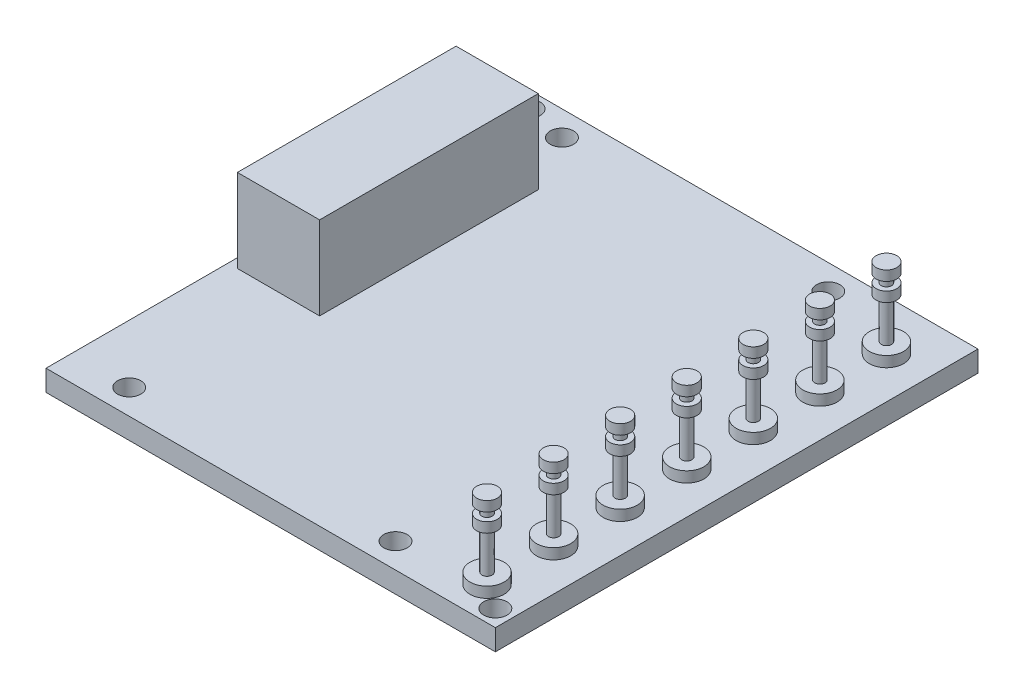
ISO-10303-21;
HEADER;
FILE_DESCRIPTION(('STEP AP214'),'2;1');
FILE_NAME('part.step','',(''),(''),'','','');
FILE_SCHEMA(('AUTOMOTIVE_DESIGN { 1 0 10303 214 1 1 1 1 }'));
ENDSEC;
DATA;
#1=APPLICATION_CONTEXT('core data for automotive mechanical design processes');
#2=APPLICATION_PROTOCOL_DEFINITION('international standard','automotive_design',2000,#1);
#3=PRODUCT_CONTEXT('',#1,'mechanical');
#4=PRODUCT('Part','Part','',(#3));
#5=PRODUCT_RELATED_PRODUCT_CATEGORY('part','',(#4));
#6=PRODUCT_DEFINITION_FORMATION('','',#4);
#7=PRODUCT_DEFINITION_CONTEXT('part definition',#1,'design');
#8=PRODUCT_DEFINITION('design','',#6,#7);
#9=PRODUCT_DEFINITION_SHAPE('','',#8);
#10=(LENGTH_UNIT() NAMED_UNIT(*) SI_UNIT(.MILLI.,.METRE.));
#11=(NAMED_UNIT(*) PLANE_ANGLE_UNIT() SI_UNIT($,.RADIAN.));
#12=(NAMED_UNIT(*) SI_UNIT($,.STERADIAN.) SOLID_ANGLE_UNIT());
#13=UNCERTAINTY_MEASURE_WITH_UNIT(LENGTH_MEASURE(1.E-05),#10,'distance_accuracy_value','');
#14=(GEOMETRIC_REPRESENTATION_CONTEXT(3) GLOBAL_UNCERTAINTY_ASSIGNED_CONTEXT((#13)) GLOBAL_UNIT_ASSIGNED_CONTEXT((#10,
#11,#12)) REPRESENTATION_CONTEXT('',''));
#15=CARTESIAN_POINT('',(0.,0.,0.));
#16=DIRECTION('',(0.,0.,1.));
#17=DIRECTION('',(1.,0.,0.));
#18=AXIS2_PLACEMENT_3D('',#15,#16,#17);
#19=CARTESIAN_POINT('',(0.,1.6002,0.));
#20=DIRECTION('',(0.,-1.,0.));
#21=DIRECTION('',(0.,0.,-1.));
#22=AXIS2_PLACEMENT_3D('',#19,#20,#21);
#23=PLANE('',#22);
#24=CARTESIAN_POINT('',(-12.7,1.6002,-16.51));
#25=DIRECTION('',(0.,1.,0.));
#26=DIRECTION('',(0.,0.,1.));
#27=AXIS2_PLACEMENT_3D('',#24,#25,#26);
#28=CIRCLE('',#27,0.888999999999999);
#29=CARTESIAN_POINT('',(-12.7,1.6002,-15.621));
#30=VERTEX_POINT('',#29);
#31=EDGE_CURVE('E437',#30,#30,#28,.T.);
#32=ORIENTED_EDGE('',*,*,#31,.F.);
#33=EDGE_LOOP('',(#32));
#34=FACE_BOUND('',#33,.T.);
#35=CARTESIAN_POINT('',(7.62,1.6002,-16.51));
#36=DIRECTION('',(0.,1.,0.));
#37=DIRECTION('',(0.,0.,1.));
#38=AXIS2_PLACEMENT_3D('',#35,#36,#37);
#39=CIRCLE('',#38,0.889);
#40=CARTESIAN_POINT('',(7.62,1.6002,-15.621));
#41=VERTEX_POINT('',#40);
#42=EDGE_CURVE('E431',#41,#41,#39,.T.);
#43=ORIENTED_EDGE('',*,*,#42,.F.);
#44=EDGE_LOOP('',(#43));
#45=FACE_BOUND('',#44,.T.);
#46=CARTESIAN_POINT('',(-12.7,1.6002,16.51));
#47=DIRECTION('',(0.,1.,0.));
#48=DIRECTION('',(0.,0.,1.));
#49=AXIS2_PLACEMENT_3D('',#46,#47,#48);
#50=CIRCLE('',#49,0.888999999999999);
#51=CARTESIAN_POINT('',(-12.7,1.6002,17.399));
#52=VERTEX_POINT('',#51);
#53=EDGE_CURVE('E425',#52,#52,#50,.T.);
#54=ORIENTED_EDGE('',*,*,#53,.F.);
#55=EDGE_LOOP('',(#54));
#56=FACE_BOUND('',#55,.T.);
#57=CARTESIAN_POINT('',(7.62,1.6002,16.51));
#58=DIRECTION('',(0.,1.,0.));
#59=DIRECTION('',(0.,0.,1.));
#60=AXIS2_PLACEMENT_3D('',#57,#58,#59);
#61=CIRCLE('',#60,0.889);
#62=CARTESIAN_POINT('',(7.62,1.6002,17.399));
#63=VERTEX_POINT('',#62);
#64=EDGE_CURVE('E419',#63,#63,#61,.T.);
#65=ORIENTED_EDGE('',*,*,#64,.F.);
#66=EDGE_LOOP('',(#65));
#67=FACE_BOUND('',#66,.T.);
#68=CARTESIAN_POINT('',(13.97,1.6002,-14.605));
#69=DIRECTION('',(0.,-1.,0.));
#70=DIRECTION('',(0.,0.,-1.));
#71=AXIS2_PLACEMENT_3D('',#68,#69,#70);
#72=CIRCLE('',#71,1.3081);
#73=CARTESIAN_POINT('',(13.97,1.6002,-15.9131));
#74=VERTEX_POINT('',#73);
#75=EDGE_CURVE('E11',#74,#74,#72,.F.);
#76=ORIENTED_EDGE('',*,*,#75,.F.);
#77=EDGE_LOOP('',(#76));
#78=FACE_BOUND('',#77,.T.);
#79=CARTESIAN_POINT('',(13.97,1.6002,-9.52500000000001));
#80=DIRECTION('',(0.,-1.,0.));
#81=DIRECTION('',(0.,0.,-1.));
#82=AXIS2_PLACEMENT_3D('',#79,#80,#81);
#83=CIRCLE('',#82,1.3081);
#84=CARTESIAN_POINT('',(13.97,1.6002,-10.8331));
#85=VERTEX_POINT('',#84);
#86=EDGE_CURVE('E42',#85,#85,#83,.F.);
#87=ORIENTED_EDGE('',*,*,#86,.F.);
#88=EDGE_LOOP('',(#87));
#89=FACE_BOUND('',#88,.T.);
#90=CARTESIAN_POINT('',(13.97,1.6002,-4.445));
#91=DIRECTION('',(0.,-1.,0.));
#92=DIRECTION('',(0.,0.,-1.));
#93=AXIS2_PLACEMENT_3D('',#90,#91,#92);
#94=CIRCLE('',#93,1.3081);
#95=CARTESIAN_POINT('',(13.97,1.6002,-5.7531));
#96=VERTEX_POINT('',#95);
#97=EDGE_CURVE('E172',#96,#96,#94,.F.);
#98=ORIENTED_EDGE('',*,*,#97,.F.);
#99=EDGE_LOOP('',(#98));
#100=FACE_BOUND('',#99,.T.);
#101=CARTESIAN_POINT('',(13.97,1.6002,0.634999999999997));
#102=DIRECTION('',(0.,-1.,0.));
#103=DIRECTION('',(0.,0.,-1.));
#104=AXIS2_PLACEMENT_3D('',#101,#102,#103);
#105=CIRCLE('',#104,1.3081);
#106=CARTESIAN_POINT('',(13.97,1.6002,-0.673100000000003));
#107=VERTEX_POINT('',#106);
#108=EDGE_CURVE('E169',#107,#107,#105,.F.);
#109=ORIENTED_EDGE('',*,*,#108,.F.);
#110=EDGE_LOOP('',(#109));
#111=FACE_BOUND('',#110,.T.);
#112=CARTESIAN_POINT('',(13.97,1.6002,5.715));
#113=DIRECTION('',(0.,-1.,0.));
#114=DIRECTION('',(0.,0.,-1.));
#115=AXIS2_PLACEMENT_3D('',#112,#113,#114);
#116=CIRCLE('',#115,1.3081);
#117=CARTESIAN_POINT('',(13.97,1.6002,4.4069));
#118=VERTEX_POINT('',#117);
#119=EDGE_CURVE('E166',#118,#118,#116,.F.);
#120=ORIENTED_EDGE('',*,*,#119,.F.);
#121=EDGE_LOOP('',(#120));
#122=FACE_BOUND('',#121,.T.);
#123=CARTESIAN_POINT('',(13.97,1.6002,10.795));
#124=DIRECTION('',(0.,-1.,0.));
#125=DIRECTION('',(0.,0.,-1.));
#126=AXIS2_PLACEMENT_3D('',#123,#124,#125);
#127=CIRCLE('',#126,1.3081);
#128=CARTESIAN_POINT('',(13.97,1.6002,9.4869));
#129=VERTEX_POINT('',#128);
#130=EDGE_CURVE('E163',#129,#129,#127,.F.);
#131=ORIENTED_EDGE('',*,*,#130,.F.);
#132=EDGE_LOOP('',(#131));
#133=FACE_BOUND('',#132,.T.);
#134=CARTESIAN_POINT('',(13.97,1.6002,15.875));
#135=DIRECTION('',(0.,-1.,0.));
#136=DIRECTION('',(0.,0.,-1.));
#137=AXIS2_PLACEMENT_3D('',#134,#135,#136);
#138=CIRCLE('',#137,1.3081);
#139=CARTESIAN_POINT('',(13.97,1.6002,14.5669));
#140=VERTEX_POINT('',#139);
#141=EDGE_CURVE('E155',#140,#140,#138,.F.);
#142=ORIENTED_EDGE('',*,*,#141,.F.);
#143=EDGE_LOOP('',(#142));
#144=FACE_BOUND('',#143,.T.);
#145=CARTESIAN_POINT('',(-15.875,1.6002,-17.145));
#146=DIRECTION('',(0.,1.,0.));
#147=DIRECTION('',(0.,0.,1.));
#148=AXIS2_PLACEMENT_3D('',#145,#146,#147);
#149=CIRCLE('',#148,0.888999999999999);
#150=CARTESIAN_POINT('',(-15.875,1.6002,-16.256));
#151=VERTEX_POINT('',#150);
#152=EDGE_CURVE('E197',#151,#151,#149,.T.);
#153=ORIENTED_EDGE('',*,*,#152,.F.);
#154=EDGE_LOOP('',(#153));
#155=FACE_BOUND('',#154,.T.);
#156=CARTESIAN_POINT('',(15.875,1.6002,17.145));
#157=DIRECTION('',(0.,1.,0.));
#158=DIRECTION('',(0.,0.,1.));
#159=AXIS2_PLACEMENT_3D('',#156,#157,#158);
#160=CIRCLE('',#159,0.889000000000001);
#161=CARTESIAN_POINT('',(15.875,1.6002,18.034));
#162=VERTEX_POINT('',#161);
#163=EDGE_CURVE('E160',#162,#162,#160,.T.);
#164=ORIENTED_EDGE('',*,*,#163,.F.);
#165=EDGE_LOOP('',(#164));
#166=FACE_BOUND('',#165,.T.);
#167=DIRECTION('',(0.,0.,-1.));
#168=VECTOR('',#167,1.);
#169=CARTESIAN_POINT('',(17.145,1.6002,18.415));
#170=LINE('',#169,#168);
#171=CARTESIAN_POINT('',(17.145,1.6002,18.415));
#172=VERTEX_POINT('',#171);
#173=CARTESIAN_POINT('',(17.145,1.6002,-18.415));
#174=VERTEX_POINT('',#173);
#175=EDGE_CURVE('E129',#172,#174,#170,.T.);
#176=ORIENTED_EDGE('',*,*,#175,.T.);
#177=DIRECTION('',(-1.,0.,0.));
#178=VECTOR('',#177,1.);
#179=CARTESIAN_POINT('',(-17.145,1.6002,-18.415));
#180=LINE('',#179,#178);
#181=CARTESIAN_POINT('',(-17.145,1.6002,-18.415));
#182=VERTEX_POINT('',#181);
#183=EDGE_CURVE('E132',#174,#182,#180,.T.);
#184=ORIENTED_EDGE('',*,*,#183,.T.);
#185=DIRECTION('',(0.,0.,1.));
#186=VECTOR('',#185,1.);
#187=CARTESIAN_POINT('',(-17.145,1.6002,18.415));
#188=LINE('',#187,#186);
#189=CARTESIAN_POINT('',(-17.145,1.6002,18.415));
#190=VERTEX_POINT('',#189);
#191=EDGE_CURVE('E135',#182,#190,#188,.T.);
#192=ORIENTED_EDGE('',*,*,#191,.T.);
#193=DIRECTION('',(1.,0.,0.));
#194=VECTOR('',#193,1.);
#195=CARTESIAN_POINT('',(-17.145,1.6002,18.415));
#196=LINE('',#195,#194);
#197=EDGE_CURVE('E137',#190,#172,#196,.T.);
#198=ORIENTED_EDGE('',*,*,#197,.T.);
#199=EDGE_LOOP('',(#176,#184,#192,#198));
#200=FACE_BOUND('',#199,.T.);
#201=DIRECTION('',(0.,0.,1.));
#202=VECTOR('',#201,1.);
#203=CARTESIAN_POINT('',(-16.4338,1.6002,-12.1666));
#204=LINE('',#203,#202);
#205=CARTESIAN_POINT('',(-16.4338,1.6002,-12.1666));
#206=VERTEX_POINT('',#205);
#207=CARTESIAN_POINT('',(-16.4338,1.6002,4.5212));
#208=VERTEX_POINT('',#207);
#209=EDGE_CURVE('E119',#206,#208,#204,.T.);
#210=ORIENTED_EDGE('',*,*,#209,.F.);
#211=DIRECTION('',(-1.,0.,0.));
#212=VECTOR('',#211,1.);
#213=CARTESIAN_POINT('',(-16.4338,1.6002,-12.1666));
#214=LINE('',#213,#212);
#215=CARTESIAN_POINT('',(-10.16,1.6002,-12.1666));
#216=VERTEX_POINT('',#215);
#217=EDGE_CURVE('E116',#216,#206,#214,.T.);
#218=ORIENTED_EDGE('',*,*,#217,.F.);
#219=DIRECTION('',(0.,0.,-1.));
#220=VECTOR('',#219,1.);
#221=CARTESIAN_POINT('',(-10.16,1.6002,-12.1666));
#222=LINE('',#221,#220);
#223=CARTESIAN_POINT('',(-10.16,1.6002,4.5212));
#224=VERTEX_POINT('',#223);
#225=EDGE_CURVE('E54',#224,#216,#222,.T.);
#226=ORIENTED_EDGE('',*,*,#225,.F.);
#227=DIRECTION('',(1.,0.,0.));
#228=VECTOR('',#227,1.);
#229=CARTESIAN_POINT('',(-16.4338,1.6002,4.5212));
#230=LINE('',#229,#228);
#231=EDGE_CURVE('E49',#208,#224,#230,.T.);
#232=ORIENTED_EDGE('',*,*,#231,.F.);
#233=EDGE_LOOP('',(#210,#218,#226,#232));
#234=FACE_BOUND('',#233,.T.);
#235=ADVANCED_FACE('F34',(#34,#45,#56,#67,#78,#89,#100,#111,#122,#133,#144,#155,#166,#200,#234),
#23,.F.);
#236=CARTESIAN_POINT('',(17.145,1.6002,18.415));
#237=DIRECTION('',(-1.,0.,0.));
#238=DIRECTION('',(0.,0.,1.));
#239=AXIS2_PLACEMENT_3D('',#236,#237,#238);
#240=PLANE('',#239);
#241=DIRECTION('',(0.,0.,-1.));
#242=VECTOR('',#241,1.);
#243=CARTESIAN_POINT('',(17.145,0.,18.415));
#244=LINE('',#243,#242);
#245=CARTESIAN_POINT('',(17.145,0.,18.415));
#246=VERTEX_POINT('',#245);
#247=CARTESIAN_POINT('',(17.145,0.,-18.415));
#248=VERTEX_POINT('',#247);
#249=EDGE_CURVE('E120',#246,#248,#244,.T.);
#250=ORIENTED_EDGE('',*,*,#249,.T.);
#251=DIRECTION('',(0.,-1.,0.));
#252=VECTOR('',#251,1.);
#253=CARTESIAN_POINT('',(17.145,1.6002,-18.415));
#254=LINE('',#253,#252);
#255=EDGE_CURVE('E152',#174,#248,#254,.T.);
#256=ORIENTED_EDGE('',*,*,#255,.F.);
#257=ORIENTED_EDGE('',*,*,#175,.F.);
#258=DIRECTION('',(0.,-1.,0.));
#259=VECTOR('',#258,1.);
#260=CARTESIAN_POINT('',(17.145,1.6002,18.415));
#261=LINE('',#260,#259);
#262=EDGE_CURVE('E138',#172,#246,#261,.T.);
#263=ORIENTED_EDGE('',*,*,#262,.T.);
#264=EDGE_LOOP('',(#250,#256,#257,#263));
#265=FACE_BOUND('',#264,.T.);
#266=ADVANCED_FACE('F36',(#265),#240,.F.);
#267=CARTESIAN_POINT('',(-17.145,1.6002,-18.415));
#268=DIRECTION('',(0.,0.,1.));
#269=DIRECTION('',(1.,0.,0.));
#270=AXIS2_PLACEMENT_3D('',#267,#268,#269);
#271=PLANE('',#270);
#272=DIRECTION('',(-1.,0.,0.));
#273=VECTOR('',#272,1.);
#274=CARTESIAN_POINT('',(-17.145,0.,-18.415));
#275=LINE('',#274,#273);
#276=CARTESIAN_POINT('',(-17.145,0.,-18.415));
#277=VERTEX_POINT('',#276);
#278=EDGE_CURVE('E123',#248,#277,#275,.T.);
#279=ORIENTED_EDGE('',*,*,#278,.T.);
#280=DIRECTION('',(0.,-1.,0.));
#281=VECTOR('',#280,1.);
#282=CARTESIAN_POINT('',(-17.145,1.6002,-18.415));
#283=LINE('',#282,#281);
#284=EDGE_CURVE('E149',#182,#277,#283,.T.);
#285=ORIENTED_EDGE('',*,*,#284,.F.);
#286=ORIENTED_EDGE('',*,*,#183,.F.);
#287=ORIENTED_EDGE('',*,*,#255,.T.);
#288=EDGE_LOOP('',(#279,#285,#286,#287));
#289=FACE_BOUND('',#288,.T.);
#290=ADVANCED_FACE('F793',(#289),#271,.F.);
#291=CARTESIAN_POINT('',(-17.145,1.6002,18.415));
#292=DIRECTION('',(1.,0.,0.));
#293=DIRECTION('',(0.,0.,-1.));
#294=AXIS2_PLACEMENT_3D('',#291,#292,#293);
#295=PLANE('',#294);
#296=DIRECTION('',(0.,0.,1.));
#297=VECTOR('',#296,1.);
#298=CARTESIAN_POINT('',(-17.145,0.,18.415));
#299=LINE('',#298,#297);
#300=CARTESIAN_POINT('',(-17.145,0.,18.415));
#301=VERTEX_POINT('',#300);
#302=EDGE_CURVE('E141',#277,#301,#299,.T.);
#303=ORIENTED_EDGE('',*,*,#302,.T.);
#304=DIRECTION('',(0.,-1.,0.));
#305=VECTOR('',#304,1.);
#306=CARTESIAN_POINT('',(-17.145,1.6002,18.415));
#307=LINE('',#306,#305);
#308=EDGE_CURVE('E146',#190,#301,#307,.T.);
#309=ORIENTED_EDGE('',*,*,#308,.F.);
#310=ORIENTED_EDGE('',*,*,#191,.F.);
#311=ORIENTED_EDGE('',*,*,#284,.T.);
#312=EDGE_LOOP('',(#303,#309,#310,#311));
#313=FACE_BOUND('',#312,.T.);
#314=ADVANCED_FACE('F790',(#313),#295,.F.);
#315=CARTESIAN_POINT('',(-17.145,1.6002,18.415));
#316=DIRECTION('',(0.,0.,-1.));
#317=DIRECTION('',(-1.,0.,0.));
#318=AXIS2_PLACEMENT_3D('',#315,#316,#317);
#319=PLANE('',#318);
#320=DIRECTION('',(1.,0.,0.));
#321=VECTOR('',#320,1.);
#322=CARTESIAN_POINT('',(-17.145,0.,18.415));
#323=LINE('',#322,#321);
#324=EDGE_CURVE('E133',#301,#246,#323,.T.);
#325=ORIENTED_EDGE('',*,*,#324,.T.);
#326=ORIENTED_EDGE('',*,*,#262,.F.);
#327=ORIENTED_EDGE('',*,*,#197,.F.);
#328=ORIENTED_EDGE('',*,*,#308,.T.);
#329=EDGE_LOOP('',(#325,#326,#327,#328));
#330=FACE_BOUND('',#329,.T.);
#331=ADVANCED_FACE('F786',(#330),#319,.F.);
#332=CARTESIAN_POINT('',(0.,0.,0.));
#333=DIRECTION('',(0.,-1.,0.));
#334=DIRECTION('',(0.,0.,-1.));
#335=AXIS2_PLACEMENT_3D('',#332,#333,#334);
#336=PLANE('',#335);
#337=CARTESIAN_POINT('',(-12.7,0.,-16.51));
#338=DIRECTION('',(0.,-1.,0.));
#339=DIRECTION('',(0.,0.,-1.));
#340=AXIS2_PLACEMENT_3D('',#337,#338,#339);
#341=CIRCLE('',#340,0.888999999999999);
#342=CARTESIAN_POINT('',(-12.7,0.,-17.399));
#343=VERTEX_POINT('',#342);
#344=EDGE_CURVE('E434',#343,#343,#341,.T.);
#345=ORIENTED_EDGE('',*,*,#344,.F.);
#346=EDGE_LOOP('',(#345));
#347=FACE_BOUND('',#346,.T.);
#348=CARTESIAN_POINT('',(7.62,0.,-16.51));
#349=DIRECTION('',(0.,-1.,0.));
#350=DIRECTION('',(0.,0.,-1.));
#351=AXIS2_PLACEMENT_3D('',#348,#349,#350);
#352=CIRCLE('',#351,0.889);
#353=CARTESIAN_POINT('',(7.62,0.,-17.399));
#354=VERTEX_POINT('',#353);
#355=EDGE_CURVE('E428',#354,#354,#352,.T.);
#356=ORIENTED_EDGE('',*,*,#355,.F.);
#357=EDGE_LOOP('',(#356));
#358=FACE_BOUND('',#357,.T.);
#359=CARTESIAN_POINT('',(-12.7,0.,16.51));
#360=DIRECTION('',(0.,-1.,0.));
#361=DIRECTION('',(0.,0.,-1.));
#362=AXIS2_PLACEMENT_3D('',#359,#360,#361);
#363=CIRCLE('',#362,0.888999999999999);
#364=CARTESIAN_POINT('',(-12.7,0.,15.621));
#365=VERTEX_POINT('',#364);
#366=EDGE_CURVE('E422',#365,#365,#363,.T.);
#367=ORIENTED_EDGE('',*,*,#366,.F.);
#368=EDGE_LOOP('',(#367));
#369=FACE_BOUND('',#368,.T.);
#370=CARTESIAN_POINT('',(7.62,0.,16.51));
#371=DIRECTION('',(0.,-1.,0.));
#372=DIRECTION('',(0.,0.,-1.));
#373=AXIS2_PLACEMENT_3D('',#370,#371,#372);
#374=CIRCLE('',#373,0.889);
#375=CARTESIAN_POINT('',(7.62,0.,15.621));
#376=VERTEX_POINT('',#375);
#377=EDGE_CURVE('E416',#376,#376,#374,.T.);
#378=ORIENTED_EDGE('',*,*,#377,.F.);
#379=EDGE_LOOP('',(#378));
#380=FACE_BOUND('',#379,.T.);
#381=CARTESIAN_POINT('',(-15.875,0.,-17.145));
#382=DIRECTION('',(0.,-1.,0.));
#383=DIRECTION('',(0.,0.,-1.));
#384=AXIS2_PLACEMENT_3D('',#381,#382,#383);
#385=CIRCLE('',#384,0.888999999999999);
#386=CARTESIAN_POINT('',(-15.875,0.,-18.034));
#387=VERTEX_POINT('',#386);
#388=EDGE_CURVE('E223',#387,#387,#385,.T.);
#389=ORIENTED_EDGE('',*,*,#388,.F.);
#390=EDGE_LOOP('',(#389));
#391=FACE_BOUND('',#390,.T.);
#392=CARTESIAN_POINT('',(15.875,0.,17.145));
#393=DIRECTION('',(0.,-1.,0.));
#394=DIRECTION('',(0.,0.,-1.));
#395=AXIS2_PLACEMENT_3D('',#392,#393,#394);
#396=CIRCLE('',#395,0.889000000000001);
#397=CARTESIAN_POINT('',(15.875,0.,16.256));
#398=VERTEX_POINT('',#397);
#399=EDGE_CURVE('E156',#398,#398,#396,.T.);
#400=ORIENTED_EDGE('',*,*,#399,.F.);
#401=EDGE_LOOP('',(#400));
#402=FACE_BOUND('',#401,.T.);
#403=CARTESIAN_POINT('',(-10.6273654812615,0.,-5.99049327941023));
#404=DIRECTION('',(0.,-1.,0.));
#405=DIRECTION('',(0.,0.,-1.));
#406=AXIS2_PLACEMENT_3D('',#403,#404,#405);
#407=CIRCLE('',#406,0.32766);
#408=CARTESIAN_POINT('',(-10.6273654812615,0.,-6.31815327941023));
#409=VERTEX_POINT('',#408);
#410=EDGE_CURVE('E159',#409,#409,#407,.T.);
#411=ORIENTED_EDGE('',*,*,#410,.F.);
#412=EDGE_LOOP('',(#411));
#413=FACE_BOUND('',#412,.T.);
#414=ORIENTED_EDGE('',*,*,#249,.F.);
#415=ORIENTED_EDGE('',*,*,#324,.F.);
#416=ORIENTED_EDGE('',*,*,#302,.F.);
#417=ORIENTED_EDGE('',*,*,#278,.F.);
#418=EDGE_LOOP('',(#414,#415,#416,#417));
#419=FACE_BOUND('',#418,.T.);
#420=ADVANCED_FACE('F782',(#347,#358,#369,#380,#391,#402,#413,#419),#336,.T.);
#421=CARTESIAN_POINT('',(-16.4338,7.9502,-12.1666));
#422=DIRECTION('',(1.,0.,0.));
#423=DIRECTION('',(0.,0.,-1.));
#424=AXIS2_PLACEMENT_3D('',#421,#422,#423);
#425=PLANE('',#424);
#426=ORIENTED_EDGE('',*,*,#209,.T.);
#427=DIRECTION('',(0.,-1.,0.));
#428=VECTOR('',#427,1.);
#429=CARTESIAN_POINT('',(-16.4338,7.9502,4.5212));
#430=LINE('',#429,#428);
#431=CARTESIAN_POINT('',(-16.4338,7.9502,4.5212));
#432=VERTEX_POINT('',#431);
#433=EDGE_CURVE('E100',#432,#208,#430,.T.);
#434=ORIENTED_EDGE('',*,*,#433,.F.);
#435=DIRECTION('',(0.,0.,1.));
#436=VECTOR('',#435,1.);
#437=CARTESIAN_POINT('',(-16.4338,7.9502,-12.1666));
#438=LINE('',#437,#436);
#439=CARTESIAN_POINT('',(-16.4338,7.9502,-12.1666));
#440=VERTEX_POINT('',#439);
#441=EDGE_CURVE('E107',#440,#432,#438,.T.);
#442=ORIENTED_EDGE('',*,*,#441,.F.);
#443=DIRECTION('',(0.,-1.,0.));
#444=VECTOR('',#443,1.);
#445=CARTESIAN_POINT('',(-16.4338,7.9502,-12.1666));
#446=LINE('',#445,#444);
#447=EDGE_CURVE('E209',#440,#206,#446,.T.);
#448=ORIENTED_EDGE('',*,*,#447,.T.);
#449=EDGE_LOOP('',(#426,#434,#442,#448));
#450=FACE_BOUND('',#449,.T.);
#451=ADVANCED_FACE('F118',(#450),#425,.F.);
#452=CARTESIAN_POINT('',(-16.4338,7.9502,4.5212));
#453=DIRECTION('',(0.,0.,-1.));
#454=DIRECTION('',(-1.,0.,0.));
#455=AXIS2_PLACEMENT_3D('',#452,#453,#454);
#456=PLANE('',#455);
#457=ORIENTED_EDGE('',*,*,#231,.T.);
#458=DIRECTION('',(0.,-1.,0.));
#459=VECTOR('',#458,1.);
#460=CARTESIAN_POINT('',(-10.16,7.9502,4.5212));
#461=LINE('',#460,#459);
#462=CARTESIAN_POINT('',(-10.16,7.9502,4.5212));
#463=VERTEX_POINT('',#462);
#464=EDGE_CURVE('E103',#463,#224,#461,.T.);
#465=ORIENTED_EDGE('',*,*,#464,.F.);
#466=DIRECTION('',(1.,0.,0.));
#467=VECTOR('',#466,1.);
#468=CARTESIAN_POINT('',(-16.4338,7.9502,4.5212));
#469=LINE('',#468,#467);
#470=EDGE_CURVE('E96',#432,#463,#469,.T.);
#471=ORIENTED_EDGE('',*,*,#470,.F.);
#472=ORIENTED_EDGE('',*,*,#433,.T.);
#473=EDGE_LOOP('',(#457,#465,#471,#472));
#474=FACE_BOUND('',#473,.T.);
#475=ADVANCED_FACE('F98',(#474),#456,.F.);
#476=CARTESIAN_POINT('',(-10.16,7.9502,-12.1666));
#477=DIRECTION('',(-1.,0.,0.));
#478=DIRECTION('',(0.,0.,1.));
#479=AXIS2_PLACEMENT_3D('',#476,#477,#478);
#480=PLANE('',#479);
#481=ORIENTED_EDGE('',*,*,#225,.T.);
#482=DIRECTION('',(0.,-1.,0.));
#483=VECTOR('',#482,1.);
#484=CARTESIAN_POINT('',(-10.16,7.9502,-12.1666));
#485=LINE('',#484,#483);
#486=CARTESIAN_POINT('',(-10.16,7.9502,-12.1666));
#487=VERTEX_POINT('',#486);
#488=EDGE_CURVE('E125',#487,#216,#485,.T.);
#489=ORIENTED_EDGE('',*,*,#488,.F.);
#490=DIRECTION('',(0.,0.,-1.));
#491=VECTOR('',#490,1.);
#492=CARTESIAN_POINT('',(-10.16,7.9502,-12.1666));
#493=LINE('',#492,#491);
#494=EDGE_CURVE('E106',#463,#487,#493,.T.);
#495=ORIENTED_EDGE('',*,*,#494,.F.);
#496=ORIENTED_EDGE('',*,*,#464,.T.);
#497=EDGE_LOOP('',(#481,#489,#495,#496));
#498=FACE_BOUND('',#497,.T.);
#499=ADVANCED_FACE('F775',(#498),#480,.F.);
#500=CARTESIAN_POINT('',(-16.4338,7.9502,-12.1666));
#501=DIRECTION('',(0.,0.,1.));
#502=DIRECTION('',(1.,0.,0.));
#503=AXIS2_PLACEMENT_3D('',#500,#501,#502);
#504=PLANE('',#503);
#505=ORIENTED_EDGE('',*,*,#217,.T.);
#506=ORIENTED_EDGE('',*,*,#447,.F.);
#507=DIRECTION('',(-1.,0.,0.));
#508=VECTOR('',#507,1.);
#509=CARTESIAN_POINT('',(-16.4338,7.9502,-12.1666));
#510=LINE('',#509,#508);
#511=EDGE_CURVE('E112',#487,#440,#510,.T.);
#512=ORIENTED_EDGE('',*,*,#511,.F.);
#513=ORIENTED_EDGE('',*,*,#488,.T.);
#514=EDGE_LOOP('',(#505,#506,#512,#513));
#515=FACE_BOUND('',#514,.T.);
#516=ADVANCED_FACE('F208',(#515),#504,.F.);
#517=CARTESIAN_POINT('',(0.,7.9502,0.));
#518=DIRECTION('',(0.,1.,0.));
#519=DIRECTION('',(0.,0.,1.));
#520=AXIS2_PLACEMENT_3D('',#517,#518,#519);
#521=PLANE('',#520);
#522=ORIENTED_EDGE('',*,*,#441,.T.);
#523=ORIENTED_EDGE('',*,*,#470,.T.);
#524=ORIENTED_EDGE('',*,*,#494,.T.);
#525=ORIENTED_EDGE('',*,*,#511,.T.);
#526=EDGE_LOOP('',(#522,#523,#524,#525));
#527=FACE_BOUND('',#526,.T.);
#528=ADVANCED_FACE('F110',(#527),#521,.T.);
#529=CARTESIAN_POINT('',(-10.6273654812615,-1.4732,-5.99049327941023));
#530=DIRECTION('',(0.,1.,0.));
#531=DIRECTION('',(0.,0.,1.));
#532=AXIS2_PLACEMENT_3D('',#529,#530,#531);
#533=CYLINDRICAL_SURFACE('',#532,0.32766);
#534=CARTESIAN_POINT('',(-10.6273654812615,-1.4732,-5.99049327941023));
#535=DIRECTION('',(0.,-1.,0.));
#536=DIRECTION('',(0.,0.,-1.));
#537=AXIS2_PLACEMENT_3D('',#534,#535,#536);
#538=CIRCLE('',#537,0.32766);
#539=CARTESIAN_POINT('',(-10.6273654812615,-1.4732,-6.31815327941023));
#540=VERTEX_POINT('',#539);
#541=EDGE_CURVE('E204',#540,#540,#538,.T.);
#542=ORIENTED_EDGE('',*,*,#541,.F.);
#543=EDGE_LOOP('',(#542));
#544=FACE_BOUND('',#543,.T.);
#545=ORIENTED_EDGE('',*,*,#410,.T.);
#546=EDGE_LOOP('',(#545));
#547=FACE_BOUND('',#546,.T.);
#548=ADVANCED_FACE('F766',(#544,#547),#533,.T.);
#549=CARTESIAN_POINT('',(-10.6273654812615,-1.4732,-5.99049327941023));
#550=DIRECTION('',(0.,-1.,0.));
#551=DIRECTION('',(0.,0.,-1.));
#552=AXIS2_PLACEMENT_3D('',#549,#550,#551);
#553=PLANE('',#552);
#554=ORIENTED_EDGE('',*,*,#541,.T.);
#555=EDGE_LOOP('',(#554));
#556=FACE_BOUND('',#555,.T.);
#557=ADVANCED_FACE('F762',(#556),#553,.T.);
#558=CARTESIAN_POINT('',(15.875,1.6002,17.145));
#559=DIRECTION('',(0.,1.,0.));
#560=DIRECTION('',(0.,0.,1.));
#561=AXIS2_PLACEMENT_3D('',#558,#559,#560);
#562=CYLINDRICAL_SURFACE('',#561,0.889000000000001);
#563=ORIENTED_EDGE('',*,*,#399,.T.);
#564=EDGE_LOOP('',(#563));
#565=FACE_BOUND('',#564,.T.);
#566=ORIENTED_EDGE('',*,*,#163,.T.);
#567=EDGE_LOOP('',(#566));
#568=FACE_BOUND('',#567,.T.);
#569=ADVANCED_FACE('F758',(#565,#568),#562,.F.);
#570=CARTESIAN_POINT('',(-15.875,1.6002,-17.145));
#571=DIRECTION('',(0.,1.,0.));
#572=DIRECTION('',(0.,0.,1.));
#573=AXIS2_PLACEMENT_3D('',#570,#571,#572);
#574=CYLINDRICAL_SURFACE('',#573,0.888999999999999);
#575=ORIENTED_EDGE('',*,*,#388,.T.);
#576=EDGE_LOOP('',(#575));
#577=FACE_BOUND('',#576,.T.);
#578=ORIENTED_EDGE('',*,*,#152,.T.);
#579=EDGE_LOOP('',(#578));
#580=FACE_BOUND('',#579,.T.);
#581=ADVANCED_FACE('F754',(#577,#580),#574,.F.);
#582=CARTESIAN_POINT('',(13.97,1.6002,15.875));
#583=DIRECTION('',(0.,-1.,0.));
#584=DIRECTION('',(0.,0.,-1.));
#585=AXIS2_PLACEMENT_3D('',#582,#583,#584);
#586=CYLINDRICAL_SURFACE('',#585,1.3081);
#587=ORIENTED_EDGE('',*,*,#141,.T.);
#588=EDGE_LOOP('',(#587));
#589=FACE_BOUND('',#588,.T.);
#590=CARTESIAN_POINT('',(13.97,2.413,15.875));
#591=DIRECTION('',(0.,-1.,0.));
#592=DIRECTION('',(0.,0.,-1.));
#593=AXIS2_PLACEMENT_3D('',#590,#591,#592);
#594=CIRCLE('',#593,1.3081);
#595=CARTESIAN_POINT('',(13.97,2.413,14.5669));
#596=VERTEX_POINT('',#595);
#597=EDGE_CURVE('E227',#596,#596,#594,.T.);
#598=ORIENTED_EDGE('',*,*,#597,.T.);
#599=EDGE_LOOP('',(#598));
#600=FACE_BOUND('',#599,.T.);
#601=ADVANCED_FACE('F750',(#589,#600),#586,.T.);
#602=CARTESIAN_POINT('',(13.97,2.413,17.1831));
#603=DIRECTION('',(0.,-1.,0.));
#604=DIRECTION('',(0.,0.,-1.));
#605=AXIS2_PLACEMENT_3D('',#602,#603,#604);
#606=PLANE('',#605);
#607=ORIENTED_EDGE('',*,*,#597,.F.);
#608=EDGE_LOOP('',(#607));
#609=FACE_BOUND('',#608,.T.);
#610=CARTESIAN_POINT('',(13.97,2.413,15.875));
#611=DIRECTION('',(0.,-1.,0.));
#612=DIRECTION('',(0.,0.,-1.));
#613=AXIS2_PLACEMENT_3D('',#610,#611,#612);
#614=CIRCLE('',#613,0.3937);
#615=CARTESIAN_POINT('',(13.97,2.413,15.4813));
#616=VERTEX_POINT('',#615);
#617=EDGE_CURVE('E230',#616,#616,#614,.T.);
#618=ORIENTED_EDGE('',*,*,#617,.T.);
#619=EDGE_LOOP('',(#618));
#620=FACE_BOUND('',#619,.T.);
#621=ADVANCED_FACE('F746',(#609,#620),#606,.F.);
#622=CARTESIAN_POINT('',(13.97,1.6002,15.875));
#623=DIRECTION('',(0.,-1.,0.));
#624=DIRECTION('',(0.,0.,-1.));
#625=AXIS2_PLACEMENT_3D('',#622,#623,#624);
#626=CYLINDRICAL_SURFACE('',#625,0.3937);
#627=ORIENTED_EDGE('',*,*,#617,.F.);
#628=EDGE_LOOP('',(#627));
#629=FACE_BOUND('',#628,.T.);
#630=CARTESIAN_POINT('',(13.97,5.5372,15.875));
#631=DIRECTION('',(0.,-1.,0.));
#632=DIRECTION('',(0.,0.,-1.));
#633=AXIS2_PLACEMENT_3D('',#630,#631,#632);
#634=CIRCLE('',#633,0.3937);
#635=CARTESIAN_POINT('',(13.97,5.5372,15.4813));
#636=VERTEX_POINT('',#635);
#637=EDGE_CURVE('E233',#636,#636,#634,.T.);
#638=ORIENTED_EDGE('',*,*,#637,.T.);
#639=EDGE_LOOP('',(#638));
#640=FACE_BOUND('',#639,.T.);
#641=ADVANCED_FACE('F742',(#629,#640),#626,.T.);
#642=CARTESIAN_POINT('',(13.97,5.5372,16.2687));
#643=DIRECTION('',(0.,1.,0.));
#644=DIRECTION('',(0.,0.,1.));
#645=AXIS2_PLACEMENT_3D('',#642,#643,#644);
#646=PLANE('',#645);
#647=ORIENTED_EDGE('',*,*,#637,.F.);
#648=EDGE_LOOP('',(#647));
#649=FACE_BOUND('',#648,.T.);
#650=CARTESIAN_POINT('',(13.97,5.5372,15.875));
#651=DIRECTION('',(0.,-1.,0.));
#652=DIRECTION('',(0.,0.,-1.));
#653=AXIS2_PLACEMENT_3D('',#650,#651,#652);
#654=CIRCLE('',#653,0.787400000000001);
#655=CARTESIAN_POINT('',(13.97,5.5372,15.0876));
#656=VERTEX_POINT('',#655);
#657=EDGE_CURVE('E236',#656,#656,#654,.T.);
#658=ORIENTED_EDGE('',*,*,#657,.T.);
#659=EDGE_LOOP('',(#658));
#660=FACE_BOUND('',#659,.T.);
#661=ADVANCED_FACE('F738',(#649,#660),#646,.F.);
#662=CARTESIAN_POINT('',(13.97,1.6002,15.875));
#663=DIRECTION('',(0.,-1.,0.));
#664=DIRECTION('',(0.,0.,-1.));
#665=AXIS2_PLACEMENT_3D('',#662,#663,#664);
#666=CYLINDRICAL_SURFACE('',#665,0.787400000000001);
#667=ORIENTED_EDGE('',*,*,#657,.F.);
#668=EDGE_LOOP('',(#667));
#669=FACE_BOUND('',#668,.T.);
#670=CARTESIAN_POINT('',(13.97,6.2992,15.875));
#671=DIRECTION('',(0.,-1.,0.));
#672=DIRECTION('',(0.,0.,-1.));
#673=AXIS2_PLACEMENT_3D('',#670,#671,#672);
#674=CIRCLE('',#673,0.787400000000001);
#675=CARTESIAN_POINT('',(13.97,6.2992,15.0876));
#676=VERTEX_POINT('',#675);
#677=EDGE_CURVE('E239',#676,#676,#674,.T.);
#678=ORIENTED_EDGE('',*,*,#677,.T.);
#679=EDGE_LOOP('',(#678));
#680=FACE_BOUND('',#679,.T.);
#681=ADVANCED_FACE('F734',(#669,#680),#666,.T.);
#682=CARTESIAN_POINT('',(13.97,6.2992,16.6624));
#683=DIRECTION('',(0.,-1.,0.));
#684=DIRECTION('',(0.,0.,-1.));
#685=AXIS2_PLACEMENT_3D('',#682,#683,#684);
#686=PLANE('',#685);
#687=ORIENTED_EDGE('',*,*,#677,.F.);
#688=EDGE_LOOP('',(#687));
#689=FACE_BOUND('',#688,.T.);
#690=CARTESIAN_POINT('',(13.97,6.2992,15.875));
#691=DIRECTION('',(0.,-1.,0.));
#692=DIRECTION('',(0.,0.,-1.));
#693=AXIS2_PLACEMENT_3D('',#690,#691,#692);
#694=CIRCLE('',#693,0.3937);
#695=CARTESIAN_POINT('',(13.97,6.2992,15.4813));
#696=VERTEX_POINT('',#695);
#697=EDGE_CURVE('E242',#696,#696,#694,.T.);
#698=ORIENTED_EDGE('',*,*,#697,.T.);
#699=EDGE_LOOP('',(#698));
#700=FACE_BOUND('',#699,.T.);
#701=ADVANCED_FACE('F730',(#689,#700),#686,.F.);
#702=CARTESIAN_POINT('',(13.97,1.6002,15.875));
#703=DIRECTION('',(0.,-1.,0.));
#704=DIRECTION('',(0.,0.,-1.));
#705=AXIS2_PLACEMENT_3D('',#702,#703,#704);
#706=CYLINDRICAL_SURFACE('',#705,0.3937);
#707=ORIENTED_EDGE('',*,*,#697,.F.);
#708=EDGE_LOOP('',(#707));
#709=FACE_BOUND('',#708,.T.);
#710=CARTESIAN_POINT('',(13.97,6.9342,15.875));
#711=DIRECTION('',(0.,-1.,0.));
#712=DIRECTION('',(0.,0.,-1.));
#713=AXIS2_PLACEMENT_3D('',#710,#711,#712);
#714=CIRCLE('',#713,0.3937);
#715=CARTESIAN_POINT('',(13.97,6.9342,15.4813));
#716=VERTEX_POINT('',#715);
#717=EDGE_CURVE('E245',#716,#716,#714,.T.);
#718=ORIENTED_EDGE('',*,*,#717,.T.);
#719=EDGE_LOOP('',(#718));
#720=FACE_BOUND('',#719,.T.);
#721=ADVANCED_FACE('F726',(#709,#720),#706,.T.);
#722=CARTESIAN_POINT('',(13.97,6.9342,16.2687));
#723=DIRECTION('',(0.,1.,0.));
#724=DIRECTION('',(0.,0.,1.));
#725=AXIS2_PLACEMENT_3D('',#722,#723,#724);
#726=PLANE('',#725);
#727=ORIENTED_EDGE('',*,*,#717,.F.);
#728=EDGE_LOOP('',(#727));
#729=FACE_BOUND('',#728,.T.);
#730=CARTESIAN_POINT('',(13.97,6.9342,15.875));
#731=DIRECTION('',(0.,-1.,0.));
#732=DIRECTION('',(0.,0.,-1.));
#733=AXIS2_PLACEMENT_3D('',#730,#731,#732);
#734=CIRCLE('',#733,0.787400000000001);
#735=CARTESIAN_POINT('',(13.97,6.9342,15.0876));
#736=VERTEX_POINT('',#735);
#737=EDGE_CURVE('E248',#736,#736,#734,.T.);
#738=ORIENTED_EDGE('',*,*,#737,.T.);
#739=EDGE_LOOP('',(#738));
#740=FACE_BOUND('',#739,.T.);
#741=ADVANCED_FACE('F722',(#729,#740),#726,.F.);
#742=CARTESIAN_POINT('',(13.97,1.6002,15.875));
#743=DIRECTION('',(0.,-1.,0.));
#744=DIRECTION('',(0.,0.,-1.));
#745=AXIS2_PLACEMENT_3D('',#742,#743,#744);
#746=CYLINDRICAL_SURFACE('',#745,0.787400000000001);
#747=ORIENTED_EDGE('',*,*,#737,.F.);
#748=EDGE_LOOP('',(#747));
#749=FACE_BOUND('',#748,.T.);
#750=CARTESIAN_POINT('',(13.97,7.6962,15.875));
#751=DIRECTION('',(0.,-1.,0.));
#752=DIRECTION('',(0.,0.,-1.));
#753=AXIS2_PLACEMENT_3D('',#750,#751,#752);
#754=CIRCLE('',#753,0.787400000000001);
#755=CARTESIAN_POINT('',(13.97,7.6962,15.0876));
#756=VERTEX_POINT('',#755);
#757=EDGE_CURVE('E251',#756,#756,#754,.T.);
#758=ORIENTED_EDGE('',*,*,#757,.T.);
#759=EDGE_LOOP('',(#758));
#760=FACE_BOUND('',#759,.T.);
#761=ADVANCED_FACE('F718',(#749,#760),#746,.T.);
#762=CARTESIAN_POINT('',(13.97,7.6962,16.6624));
#763=DIRECTION('',(0.,-1.,0.));
#764=DIRECTION('',(0.,0.,-1.));
#765=AXIS2_PLACEMENT_3D('',#762,#763,#764);
#766=PLANE('',#765);
#767=ORIENTED_EDGE('',*,*,#757,.F.);
#768=EDGE_LOOP('',(#767));
#769=FACE_BOUND('',#768,.T.);
#770=ADVANCED_FACE('F714',(#769),#766,.F.);
#771=CARTESIAN_POINT('',(13.97,1.6002,10.795));
#772=DIRECTION('',(0.,-1.,0.));
#773=DIRECTION('',(0.,0.,-1.));
#774=AXIS2_PLACEMENT_3D('',#771,#772,#773);
#775=CYLINDRICAL_SURFACE('',#774,1.3081);
#776=ORIENTED_EDGE('',*,*,#130,.T.);
#777=EDGE_LOOP('',(#776));
#778=FACE_BOUND('',#777,.T.);
#779=CARTESIAN_POINT('',(13.97,2.413,10.795));
#780=DIRECTION('',(0.,-1.,0.));
#781=DIRECTION('',(0.,0.,-1.));
#782=AXIS2_PLACEMENT_3D('',#779,#780,#781);
#783=CIRCLE('',#782,1.3081);
#784=CARTESIAN_POINT('',(13.97,2.413,9.4869));
#785=VERTEX_POINT('',#784);
#786=EDGE_CURVE('E254',#785,#785,#783,.T.);
#787=ORIENTED_EDGE('',*,*,#786,.T.);
#788=EDGE_LOOP('',(#787));
#789=FACE_BOUND('',#788,.T.);
#790=ADVANCED_FACE('F710',(#778,#789),#775,.T.);
#791=CARTESIAN_POINT('',(13.97,2.413,12.1031));
#792=DIRECTION('',(0.,-1.,0.));
#793=DIRECTION('',(0.,0.,-1.));
#794=AXIS2_PLACEMENT_3D('',#791,#792,#793);
#795=PLANE('',#794);
#796=ORIENTED_EDGE('',*,*,#786,.F.);
#797=EDGE_LOOP('',(#796));
#798=FACE_BOUND('',#797,.T.);
#799=CARTESIAN_POINT('',(13.97,2.413,10.795));
#800=DIRECTION('',(0.,-1.,0.));
#801=DIRECTION('',(0.,0.,-1.));
#802=AXIS2_PLACEMENT_3D('',#799,#800,#801);
#803=CIRCLE('',#802,0.3937);
#804=CARTESIAN_POINT('',(13.97,2.413,10.4013));
#805=VERTEX_POINT('',#804);
#806=EDGE_CURVE('E257',#805,#805,#803,.T.);
#807=ORIENTED_EDGE('',*,*,#806,.T.);
#808=EDGE_LOOP('',(#807));
#809=FACE_BOUND('',#808,.T.);
#810=ADVANCED_FACE('F706',(#798,#809),#795,.F.);
#811=CARTESIAN_POINT('',(13.97,1.6002,10.795));
#812=DIRECTION('',(0.,-1.,0.));
#813=DIRECTION('',(0.,0.,-1.));
#814=AXIS2_PLACEMENT_3D('',#811,#812,#813);
#815=CYLINDRICAL_SURFACE('',#814,0.3937);
#816=ORIENTED_EDGE('',*,*,#806,.F.);
#817=EDGE_LOOP('',(#816));
#818=FACE_BOUND('',#817,.T.);
#819=CARTESIAN_POINT('',(13.97,5.5372,10.795));
#820=DIRECTION('',(0.,-1.,0.));
#821=DIRECTION('',(0.,0.,-1.));
#822=AXIS2_PLACEMENT_3D('',#819,#820,#821);
#823=CIRCLE('',#822,0.3937);
#824=CARTESIAN_POINT('',(13.97,5.5372,10.4013));
#825=VERTEX_POINT('',#824);
#826=EDGE_CURVE('E260',#825,#825,#823,.T.);
#827=ORIENTED_EDGE('',*,*,#826,.T.);
#828=EDGE_LOOP('',(#827));
#829=FACE_BOUND('',#828,.T.);
#830=ADVANCED_FACE('F702',(#818,#829),#815,.T.);
#831=CARTESIAN_POINT('',(13.97,5.5372,11.1887));
#832=DIRECTION('',(0.,1.,0.));
#833=DIRECTION('',(0.,0.,1.));
#834=AXIS2_PLACEMENT_3D('',#831,#832,#833);
#835=PLANE('',#834);
#836=ORIENTED_EDGE('',*,*,#826,.F.);
#837=EDGE_LOOP('',(#836));
#838=FACE_BOUND('',#837,.T.);
#839=CARTESIAN_POINT('',(13.97,5.5372,10.795));
#840=DIRECTION('',(0.,-1.,0.));
#841=DIRECTION('',(0.,0.,-1.));
#842=AXIS2_PLACEMENT_3D('',#839,#840,#841);
#843=CIRCLE('',#842,0.787400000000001);
#844=CARTESIAN_POINT('',(13.97,5.5372,10.0076));
#845=VERTEX_POINT('',#844);
#846=EDGE_CURVE('E263',#845,#845,#843,.T.);
#847=ORIENTED_EDGE('',*,*,#846,.T.);
#848=EDGE_LOOP('',(#847));
#849=FACE_BOUND('',#848,.T.);
#850=ADVANCED_FACE('F698',(#838,#849),#835,.F.);
#851=CARTESIAN_POINT('',(13.97,1.6002,10.795));
#852=DIRECTION('',(0.,-1.,0.));
#853=DIRECTION('',(0.,0.,-1.));
#854=AXIS2_PLACEMENT_3D('',#851,#852,#853);
#855=CYLINDRICAL_SURFACE('',#854,0.787400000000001);
#856=ORIENTED_EDGE('',*,*,#846,.F.);
#857=EDGE_LOOP('',(#856));
#858=FACE_BOUND('',#857,.T.);
#859=CARTESIAN_POINT('',(13.97,6.2992,10.795));
#860=DIRECTION('',(0.,-1.,0.));
#861=DIRECTION('',(0.,0.,-1.));
#862=AXIS2_PLACEMENT_3D('',#859,#860,#861);
#863=CIRCLE('',#862,0.787400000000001);
#864=CARTESIAN_POINT('',(13.97,6.2992,10.0076));
#865=VERTEX_POINT('',#864);
#866=EDGE_CURVE('E266',#865,#865,#863,.T.);
#867=ORIENTED_EDGE('',*,*,#866,.T.);
#868=EDGE_LOOP('',(#867));
#869=FACE_BOUND('',#868,.T.);
#870=ADVANCED_FACE('F694',(#858,#869),#855,.T.);
#871=CARTESIAN_POINT('',(13.97,6.2992,11.5824));
#872=DIRECTION('',(0.,-1.,0.));
#873=DIRECTION('',(0.,0.,-1.));
#874=AXIS2_PLACEMENT_3D('',#871,#872,#873);
#875=PLANE('',#874);
#876=ORIENTED_EDGE('',*,*,#866,.F.);
#877=EDGE_LOOP('',(#876));
#878=FACE_BOUND('',#877,.T.);
#879=CARTESIAN_POINT('',(13.97,6.2992,10.795));
#880=DIRECTION('',(0.,-1.,0.));
#881=DIRECTION('',(0.,0.,-1.));
#882=AXIS2_PLACEMENT_3D('',#879,#880,#881);
#883=CIRCLE('',#882,0.3937);
#884=CARTESIAN_POINT('',(13.97,6.2992,10.4013));
#885=VERTEX_POINT('',#884);
#886=EDGE_CURVE('E269',#885,#885,#883,.T.);
#887=ORIENTED_EDGE('',*,*,#886,.T.);
#888=EDGE_LOOP('',(#887));
#889=FACE_BOUND('',#888,.T.);
#890=ADVANCED_FACE('F690',(#878,#889),#875,.F.);
#891=CARTESIAN_POINT('',(13.97,1.6002,10.795));
#892=DIRECTION('',(0.,-1.,0.));
#893=DIRECTION('',(0.,0.,-1.));
#894=AXIS2_PLACEMENT_3D('',#891,#892,#893);
#895=CYLINDRICAL_SURFACE('',#894,0.3937);
#896=ORIENTED_EDGE('',*,*,#886,.F.);
#897=EDGE_LOOP('',(#896));
#898=FACE_BOUND('',#897,.T.);
#899=CARTESIAN_POINT('',(13.97,6.9342,10.795));
#900=DIRECTION('',(0.,-1.,0.));
#901=DIRECTION('',(0.,0.,-1.));
#902=AXIS2_PLACEMENT_3D('',#899,#900,#901);
#903=CIRCLE('',#902,0.3937);
#904=CARTESIAN_POINT('',(13.97,6.9342,10.4013));
#905=VERTEX_POINT('',#904);
#906=EDGE_CURVE('E272',#905,#905,#903,.T.);
#907=ORIENTED_EDGE('',*,*,#906,.T.);
#908=EDGE_LOOP('',(#907));
#909=FACE_BOUND('',#908,.T.);
#910=ADVANCED_FACE('F686',(#898,#909),#895,.T.);
#911=CARTESIAN_POINT('',(13.97,6.9342,11.1887));
#912=DIRECTION('',(0.,1.,0.));
#913=DIRECTION('',(0.,0.,1.));
#914=AXIS2_PLACEMENT_3D('',#911,#912,#913);
#915=PLANE('',#914);
#916=ORIENTED_EDGE('',*,*,#906,.F.);
#917=EDGE_LOOP('',(#916));
#918=FACE_BOUND('',#917,.T.);
#919=CARTESIAN_POINT('',(13.97,6.9342,10.795));
#920=DIRECTION('',(0.,-1.,0.));
#921=DIRECTION('',(0.,0.,-1.));
#922=AXIS2_PLACEMENT_3D('',#919,#920,#921);
#923=CIRCLE('',#922,0.787400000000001);
#924=CARTESIAN_POINT('',(13.97,6.9342,10.0076));
#925=VERTEX_POINT('',#924);
#926=EDGE_CURVE('E275',#925,#925,#923,.T.);
#927=ORIENTED_EDGE('',*,*,#926,.T.);
#928=EDGE_LOOP('',(#927));
#929=FACE_BOUND('',#928,.T.);
#930=ADVANCED_FACE('F682',(#918,#929),#915,.F.);
#931=CARTESIAN_POINT('',(13.97,1.6002,10.795));
#932=DIRECTION('',(0.,-1.,0.));
#933=DIRECTION('',(0.,0.,-1.));
#934=AXIS2_PLACEMENT_3D('',#931,#932,#933);
#935=CYLINDRICAL_SURFACE('',#934,0.787400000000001);
#936=ORIENTED_EDGE('',*,*,#926,.F.);
#937=EDGE_LOOP('',(#936));
#938=FACE_BOUND('',#937,.T.);
#939=CARTESIAN_POINT('',(13.97,7.6962,10.795));
#940=DIRECTION('',(0.,-1.,0.));
#941=DIRECTION('',(0.,0.,-1.));
#942=AXIS2_PLACEMENT_3D('',#939,#940,#941);
#943=CIRCLE('',#942,0.787400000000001);
#944=CARTESIAN_POINT('',(13.97,7.6962,10.0076));
#945=VERTEX_POINT('',#944);
#946=EDGE_CURVE('E278',#945,#945,#943,.T.);
#947=ORIENTED_EDGE('',*,*,#946,.T.);
#948=EDGE_LOOP('',(#947));
#949=FACE_BOUND('',#948,.T.);
#950=ADVANCED_FACE('F678',(#938,#949),#935,.T.);
#951=CARTESIAN_POINT('',(13.97,7.6962,11.5824));
#952=DIRECTION('',(0.,-1.,0.));
#953=DIRECTION('',(0.,0.,-1.));
#954=AXIS2_PLACEMENT_3D('',#951,#952,#953);
#955=PLANE('',#954);
#956=ORIENTED_EDGE('',*,*,#946,.F.);
#957=EDGE_LOOP('',(#956));
#958=FACE_BOUND('',#957,.T.);
#959=ADVANCED_FACE('F674',(#958),#955,.F.);
#960=CARTESIAN_POINT('',(13.97,1.6002,5.715));
#961=DIRECTION('',(0.,-1.,0.));
#962=DIRECTION('',(0.,0.,-1.));
#963=AXIS2_PLACEMENT_3D('',#960,#961,#962);
#964=CYLINDRICAL_SURFACE('',#963,1.3081);
#965=ORIENTED_EDGE('',*,*,#119,.T.);
#966=EDGE_LOOP('',(#965));
#967=FACE_BOUND('',#966,.T.);
#968=CARTESIAN_POINT('',(13.97,2.413,5.715));
#969=DIRECTION('',(0.,-1.,0.));
#970=DIRECTION('',(0.,0.,-1.));
#971=AXIS2_PLACEMENT_3D('',#968,#969,#970);
#972=CIRCLE('',#971,1.3081);
#973=CARTESIAN_POINT('',(13.97,2.413,4.4069));
#974=VERTEX_POINT('',#973);
#975=EDGE_CURVE('E281',#974,#974,#972,.T.);
#976=ORIENTED_EDGE('',*,*,#975,.T.);
#977=EDGE_LOOP('',(#976));
#978=FACE_BOUND('',#977,.T.);
#979=ADVANCED_FACE('F670',(#967,#978),#964,.T.);
#980=CARTESIAN_POINT('',(13.97,2.413,7.0231));
#981=DIRECTION('',(0.,-1.,0.));
#982=DIRECTION('',(0.,0.,-1.));
#983=AXIS2_PLACEMENT_3D('',#980,#981,#982);
#984=PLANE('',#983);
#985=ORIENTED_EDGE('',*,*,#975,.F.);
#986=EDGE_LOOP('',(#985));
#987=FACE_BOUND('',#986,.T.);
#988=CARTESIAN_POINT('',(13.97,2.413,5.715));
#989=DIRECTION('',(0.,-1.,0.));
#990=DIRECTION('',(0.,0.,-1.));
#991=AXIS2_PLACEMENT_3D('',#988,#989,#990);
#992=CIRCLE('',#991,0.3937);
#993=CARTESIAN_POINT('',(13.97,2.413,5.3213));
#994=VERTEX_POINT('',#993);
#995=EDGE_CURVE('E284',#994,#994,#992,.T.);
#996=ORIENTED_EDGE('',*,*,#995,.T.);
#997=EDGE_LOOP('',(#996));
#998=FACE_BOUND('',#997,.T.);
#999=ADVANCED_FACE('F666',(#987,#998),#984,.F.);
#1000=CARTESIAN_POINT('',(13.97,1.6002,5.715));
#1001=DIRECTION('',(0.,-1.,0.));
#1002=DIRECTION('',(0.,0.,-1.));
#1003=AXIS2_PLACEMENT_3D('',#1000,#1001,#1002);
#1004=CYLINDRICAL_SURFACE('',#1003,0.3937);
#1005=ORIENTED_EDGE('',*,*,#995,.F.);
#1006=EDGE_LOOP('',(#1005));
#1007=FACE_BOUND('',#1006,.T.);
#1008=CARTESIAN_POINT('',(13.97,5.5372,5.715));
#1009=DIRECTION('',(0.,-1.,0.));
#1010=DIRECTION('',(0.,0.,-1.));
#1011=AXIS2_PLACEMENT_3D('',#1008,#1009,#1010);
#1012=CIRCLE('',#1011,0.3937);
#1013=CARTESIAN_POINT('',(13.97,5.5372,5.3213));
#1014=VERTEX_POINT('',#1013);
#1015=EDGE_CURVE('E287',#1014,#1014,#1012,.T.);
#1016=ORIENTED_EDGE('',*,*,#1015,.T.);
#1017=EDGE_LOOP('',(#1016));
#1018=FACE_BOUND('',#1017,.T.);
#1019=ADVANCED_FACE('F662',(#1007,#1018),#1004,.T.);
#1020=CARTESIAN_POINT('',(13.97,5.5372,6.1087));
#1021=DIRECTION('',(0.,1.,0.));
#1022=DIRECTION('',(0.,0.,1.));
#1023=AXIS2_PLACEMENT_3D('',#1020,#1021,#1022);
#1024=PLANE('',#1023);
#1025=ORIENTED_EDGE('',*,*,#1015,.F.);
#1026=EDGE_LOOP('',(#1025));
#1027=FACE_BOUND('',#1026,.T.);
#1028=CARTESIAN_POINT('',(13.97,5.5372,5.715));
#1029=DIRECTION('',(0.,-1.,0.));
#1030=DIRECTION('',(0.,0.,-1.));
#1031=AXIS2_PLACEMENT_3D('',#1028,#1029,#1030);
#1032=CIRCLE('',#1031,0.787400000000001);
#1033=CARTESIAN_POINT('',(13.97,5.5372,4.9276));
#1034=VERTEX_POINT('',#1033);
#1035=EDGE_CURVE('E290',#1034,#1034,#1032,.T.);
#1036=ORIENTED_EDGE('',*,*,#1035,.T.);
#1037=EDGE_LOOP('',(#1036));
#1038=FACE_BOUND('',#1037,.T.);
#1039=ADVANCED_FACE('F658',(#1027,#1038),#1024,.F.);
#1040=CARTESIAN_POINT('',(13.97,1.6002,5.715));
#1041=DIRECTION('',(0.,-1.,0.));
#1042=DIRECTION('',(0.,0.,-1.));
#1043=AXIS2_PLACEMENT_3D('',#1040,#1041,#1042);
#1044=CYLINDRICAL_SURFACE('',#1043,0.787400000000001);
#1045=ORIENTED_EDGE('',*,*,#1035,.F.);
#1046=EDGE_LOOP('',(#1045));
#1047=FACE_BOUND('',#1046,.T.);
#1048=CARTESIAN_POINT('',(13.97,6.2992,5.715));
#1049=DIRECTION('',(0.,-1.,0.));
#1050=DIRECTION('',(0.,0.,-1.));
#1051=AXIS2_PLACEMENT_3D('',#1048,#1049,#1050);
#1052=CIRCLE('',#1051,0.787400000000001);
#1053=CARTESIAN_POINT('',(13.97,6.2992,4.9276));
#1054=VERTEX_POINT('',#1053);
#1055=EDGE_CURVE('E293',#1054,#1054,#1052,.T.);
#1056=ORIENTED_EDGE('',*,*,#1055,.T.);
#1057=EDGE_LOOP('',(#1056));
#1058=FACE_BOUND('',#1057,.T.);
#1059=ADVANCED_FACE('F654',(#1047,#1058),#1044,.T.);
#1060=CARTESIAN_POINT('',(13.97,6.2992,6.5024));
#1061=DIRECTION('',(0.,-1.,0.));
#1062=DIRECTION('',(0.,0.,-1.));
#1063=AXIS2_PLACEMENT_3D('',#1060,#1061,#1062);
#1064=PLANE('',#1063);
#1065=ORIENTED_EDGE('',*,*,#1055,.F.);
#1066=EDGE_LOOP('',(#1065));
#1067=FACE_BOUND('',#1066,.T.);
#1068=CARTESIAN_POINT('',(13.97,6.2992,5.715));
#1069=DIRECTION('',(0.,-1.,0.));
#1070=DIRECTION('',(0.,0.,-1.));
#1071=AXIS2_PLACEMENT_3D('',#1068,#1069,#1070);
#1072=CIRCLE('',#1071,0.3937);
#1073=CARTESIAN_POINT('',(13.97,6.2992,5.3213));
#1074=VERTEX_POINT('',#1073);
#1075=EDGE_CURVE('E296',#1074,#1074,#1072,.T.);
#1076=ORIENTED_EDGE('',*,*,#1075,.T.);
#1077=EDGE_LOOP('',(#1076));
#1078=FACE_BOUND('',#1077,.T.);
#1079=ADVANCED_FACE('F650',(#1067,#1078),#1064,.F.);
#1080=CARTESIAN_POINT('',(13.97,1.6002,5.715));
#1081=DIRECTION('',(0.,-1.,0.));
#1082=DIRECTION('',(0.,0.,-1.));
#1083=AXIS2_PLACEMENT_3D('',#1080,#1081,#1082);
#1084=CYLINDRICAL_SURFACE('',#1083,0.3937);
#1085=ORIENTED_EDGE('',*,*,#1075,.F.);
#1086=EDGE_LOOP('',(#1085));
#1087=FACE_BOUND('',#1086,.T.);
#1088=CARTESIAN_POINT('',(13.97,6.9342,5.715));
#1089=DIRECTION('',(0.,-1.,0.));
#1090=DIRECTION('',(0.,0.,-1.));
#1091=AXIS2_PLACEMENT_3D('',#1088,#1089,#1090);
#1092=CIRCLE('',#1091,0.3937);
#1093=CARTESIAN_POINT('',(13.97,6.9342,5.3213));
#1094=VERTEX_POINT('',#1093);
#1095=EDGE_CURVE('E299',#1094,#1094,#1092,.T.);
#1096=ORIENTED_EDGE('',*,*,#1095,.T.);
#1097=EDGE_LOOP('',(#1096));
#1098=FACE_BOUND('',#1097,.T.);
#1099=ADVANCED_FACE('F646',(#1087,#1098),#1084,.T.);
#1100=CARTESIAN_POINT('',(13.97,6.9342,6.1087));
#1101=DIRECTION('',(0.,1.,0.));
#1102=DIRECTION('',(0.,0.,1.));
#1103=AXIS2_PLACEMENT_3D('',#1100,#1101,#1102);
#1104=PLANE('',#1103);
#1105=ORIENTED_EDGE('',*,*,#1095,.F.);
#1106=EDGE_LOOP('',(#1105));
#1107=FACE_BOUND('',#1106,.T.);
#1108=CARTESIAN_POINT('',(13.97,6.9342,5.715));
#1109=DIRECTION('',(0.,-1.,0.));
#1110=DIRECTION('',(0.,0.,-1.));
#1111=AXIS2_PLACEMENT_3D('',#1108,#1109,#1110);
#1112=CIRCLE('',#1111,0.787400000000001);
#1113=CARTESIAN_POINT('',(13.97,6.9342,4.9276));
#1114=VERTEX_POINT('',#1113);
#1115=EDGE_CURVE('E302',#1114,#1114,#1112,.T.);
#1116=ORIENTED_EDGE('',*,*,#1115,.T.);
#1117=EDGE_LOOP('',(#1116));
#1118=FACE_BOUND('',#1117,.T.);
#1119=ADVANCED_FACE('F642',(#1107,#1118),#1104,.F.);
#1120=CARTESIAN_POINT('',(13.97,1.6002,5.715));
#1121=DIRECTION('',(0.,-1.,0.));
#1122=DIRECTION('',(0.,0.,-1.));
#1123=AXIS2_PLACEMENT_3D('',#1120,#1121,#1122);
#1124=CYLINDRICAL_SURFACE('',#1123,0.787400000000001);
#1125=ORIENTED_EDGE('',*,*,#1115,.F.);
#1126=EDGE_LOOP('',(#1125));
#1127=FACE_BOUND('',#1126,.T.);
#1128=CARTESIAN_POINT('',(13.97,7.6962,5.715));
#1129=DIRECTION('',(0.,-1.,0.));
#1130=DIRECTION('',(0.,0.,-1.));
#1131=AXIS2_PLACEMENT_3D('',#1128,#1129,#1130);
#1132=CIRCLE('',#1131,0.787400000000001);
#1133=CARTESIAN_POINT('',(13.97,7.6962,4.9276));
#1134=VERTEX_POINT('',#1133);
#1135=EDGE_CURVE('E305',#1134,#1134,#1132,.T.);
#1136=ORIENTED_EDGE('',*,*,#1135,.T.);
#1137=EDGE_LOOP('',(#1136));
#1138=FACE_BOUND('',#1137,.T.);
#1139=ADVANCED_FACE('F638',(#1127,#1138),#1124,.T.);
#1140=CARTESIAN_POINT('',(13.97,7.6962,6.5024));
#1141=DIRECTION('',(0.,-1.,0.));
#1142=DIRECTION('',(0.,0.,-1.));
#1143=AXIS2_PLACEMENT_3D('',#1140,#1141,#1142);
#1144=PLANE('',#1143);
#1145=ORIENTED_EDGE('',*,*,#1135,.F.);
#1146=EDGE_LOOP('',(#1145));
#1147=FACE_BOUND('',#1146,.T.);
#1148=ADVANCED_FACE('F634',(#1147),#1144,.F.);
#1149=CARTESIAN_POINT('',(13.97,1.6002,0.634999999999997));
#1150=DIRECTION('',(0.,-1.,0.));
#1151=DIRECTION('',(0.,0.,-1.));
#1152=AXIS2_PLACEMENT_3D('',#1149,#1150,#1151);
#1153=CYLINDRICAL_SURFACE('',#1152,1.3081);
#1154=ORIENTED_EDGE('',*,*,#108,.T.);
#1155=EDGE_LOOP('',(#1154));
#1156=FACE_BOUND('',#1155,.T.);
#1157=CARTESIAN_POINT('',(13.97,2.413,0.634999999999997));
#1158=DIRECTION('',(0.,-1.,0.));
#1159=DIRECTION('',(0.,0.,-1.));
#1160=AXIS2_PLACEMENT_3D('',#1157,#1158,#1159);
#1161=CIRCLE('',#1160,1.3081);
#1162=CARTESIAN_POINT('',(13.97,2.413,-0.673100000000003));
#1163=VERTEX_POINT('',#1162);
#1164=EDGE_CURVE('E308',#1163,#1163,#1161,.T.);
#1165=ORIENTED_EDGE('',*,*,#1164,.T.);
#1166=EDGE_LOOP('',(#1165));
#1167=FACE_BOUND('',#1166,.T.);
#1168=ADVANCED_FACE('F630',(#1156,#1167),#1153,.T.);
#1169=CARTESIAN_POINT('',(13.97,2.413,1.9431));
#1170=DIRECTION('',(0.,-1.,0.));
#1171=DIRECTION('',(0.,0.,-1.));
#1172=AXIS2_PLACEMENT_3D('',#1169,#1170,#1171);
#1173=PLANE('',#1172);
#1174=ORIENTED_EDGE('',*,*,#1164,.F.);
#1175=EDGE_LOOP('',(#1174));
#1176=FACE_BOUND('',#1175,.T.);
#1177=CARTESIAN_POINT('',(13.97,2.413,0.634999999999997));
#1178=DIRECTION('',(0.,-1.,0.));
#1179=DIRECTION('',(0.,0.,-1.));
#1180=AXIS2_PLACEMENT_3D('',#1177,#1178,#1179);
#1181=CIRCLE('',#1180,0.3937);
#1182=CARTESIAN_POINT('',(13.97,2.413,0.241299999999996));
#1183=VERTEX_POINT('',#1182);
#1184=EDGE_CURVE('E311',#1183,#1183,#1181,.T.);
#1185=ORIENTED_EDGE('',*,*,#1184,.T.);
#1186=EDGE_LOOP('',(#1185));
#1187=FACE_BOUND('',#1186,.T.);
#1188=ADVANCED_FACE('F626',(#1176,#1187),#1173,.F.);
#1189=CARTESIAN_POINT('',(13.97,1.6002,0.634999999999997));
#1190=DIRECTION('',(0.,-1.,0.));
#1191=DIRECTION('',(0.,0.,-1.));
#1192=AXIS2_PLACEMENT_3D('',#1189,#1190,#1191);
#1193=CYLINDRICAL_SURFACE('',#1192,0.3937);
#1194=ORIENTED_EDGE('',*,*,#1184,.F.);
#1195=EDGE_LOOP('',(#1194));
#1196=FACE_BOUND('',#1195,.T.);
#1197=CARTESIAN_POINT('',(13.97,5.5372,0.634999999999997));
#1198=DIRECTION('',(0.,-1.,0.));
#1199=DIRECTION('',(0.,0.,-1.));
#1200=AXIS2_PLACEMENT_3D('',#1197,#1198,#1199);
#1201=CIRCLE('',#1200,0.3937);
#1202=CARTESIAN_POINT('',(13.97,5.5372,0.241299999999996));
#1203=VERTEX_POINT('',#1202);
#1204=EDGE_CURVE('E314',#1203,#1203,#1201,.T.);
#1205=ORIENTED_EDGE('',*,*,#1204,.T.);
#1206=EDGE_LOOP('',(#1205));
#1207=FACE_BOUND('',#1206,.T.);
#1208=ADVANCED_FACE('F622',(#1196,#1207),#1193,.T.);
#1209=CARTESIAN_POINT('',(13.97,5.5372,1.0287));
#1210=DIRECTION('',(0.,1.,0.));
#1211=DIRECTION('',(0.,0.,1.));
#1212=AXIS2_PLACEMENT_3D('',#1209,#1210,#1211);
#1213=PLANE('',#1212);
#1214=ORIENTED_EDGE('',*,*,#1204,.F.);
#1215=EDGE_LOOP('',(#1214));
#1216=FACE_BOUND('',#1215,.T.);
#1217=CARTESIAN_POINT('',(13.97,5.5372,0.634999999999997));
#1218=DIRECTION('',(0.,-1.,0.));
#1219=DIRECTION('',(0.,0.,-1.));
#1220=AXIS2_PLACEMENT_3D('',#1217,#1218,#1219);
#1221=CIRCLE('',#1220,0.787400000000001);
#1222=CARTESIAN_POINT('',(13.97,5.5372,-0.152400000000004));
#1223=VERTEX_POINT('',#1222);
#1224=EDGE_CURVE('E317',#1223,#1223,#1221,.T.);
#1225=ORIENTED_EDGE('',*,*,#1224,.T.);
#1226=EDGE_LOOP('',(#1225));
#1227=FACE_BOUND('',#1226,.T.);
#1228=ADVANCED_FACE('F618',(#1216,#1227),#1213,.F.);
#1229=CARTESIAN_POINT('',(13.97,1.6002,0.634999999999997));
#1230=DIRECTION('',(0.,-1.,0.));
#1231=DIRECTION('',(0.,0.,-1.));
#1232=AXIS2_PLACEMENT_3D('',#1229,#1230,#1231);
#1233=CYLINDRICAL_SURFACE('',#1232,0.787400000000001);
#1234=ORIENTED_EDGE('',*,*,#1224,.F.);
#1235=EDGE_LOOP('',(#1234));
#1236=FACE_BOUND('',#1235,.T.);
#1237=CARTESIAN_POINT('',(13.97,6.2992,0.634999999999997));
#1238=DIRECTION('',(0.,-1.,0.));
#1239=DIRECTION('',(0.,0.,-1.));
#1240=AXIS2_PLACEMENT_3D('',#1237,#1238,#1239);
#1241=CIRCLE('',#1240,0.787400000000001);
#1242=CARTESIAN_POINT('',(13.97,6.2992,-0.152400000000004));
#1243=VERTEX_POINT('',#1242);
#1244=EDGE_CURVE('E320',#1243,#1243,#1241,.T.);
#1245=ORIENTED_EDGE('',*,*,#1244,.T.);
#1246=EDGE_LOOP('',(#1245));
#1247=FACE_BOUND('',#1246,.T.);
#1248=ADVANCED_FACE('F614',(#1236,#1247),#1233,.T.);
#1249=CARTESIAN_POINT('',(13.97,6.2992,1.4224));
#1250=DIRECTION('',(0.,-1.,0.));
#1251=DIRECTION('',(0.,0.,-1.));
#1252=AXIS2_PLACEMENT_3D('',#1249,#1250,#1251);
#1253=PLANE('',#1252);
#1254=ORIENTED_EDGE('',*,*,#1244,.F.);
#1255=EDGE_LOOP('',(#1254));
#1256=FACE_BOUND('',#1255,.T.);
#1257=CARTESIAN_POINT('',(13.97,6.2992,0.634999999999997));
#1258=DIRECTION('',(0.,-1.,0.));
#1259=DIRECTION('',(0.,0.,-1.));
#1260=AXIS2_PLACEMENT_3D('',#1257,#1258,#1259);
#1261=CIRCLE('',#1260,0.3937);
#1262=CARTESIAN_POINT('',(13.97,6.2992,0.241299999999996));
#1263=VERTEX_POINT('',#1262);
#1264=EDGE_CURVE('E323',#1263,#1263,#1261,.T.);
#1265=ORIENTED_EDGE('',*,*,#1264,.T.);
#1266=EDGE_LOOP('',(#1265));
#1267=FACE_BOUND('',#1266,.T.);
#1268=ADVANCED_FACE('F610',(#1256,#1267),#1253,.F.);
#1269=CARTESIAN_POINT('',(13.97,1.6002,0.634999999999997));
#1270=DIRECTION('',(0.,-1.,0.));
#1271=DIRECTION('',(0.,0.,-1.));
#1272=AXIS2_PLACEMENT_3D('',#1269,#1270,#1271);
#1273=CYLINDRICAL_SURFACE('',#1272,0.3937);
#1274=ORIENTED_EDGE('',*,*,#1264,.F.);
#1275=EDGE_LOOP('',(#1274));
#1276=FACE_BOUND('',#1275,.T.);
#1277=CARTESIAN_POINT('',(13.97,6.9342,0.634999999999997));
#1278=DIRECTION('',(0.,-1.,0.));
#1279=DIRECTION('',(0.,0.,-1.));
#1280=AXIS2_PLACEMENT_3D('',#1277,#1278,#1279);
#1281=CIRCLE('',#1280,0.3937);
#1282=CARTESIAN_POINT('',(13.97,6.9342,0.241299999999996));
#1283=VERTEX_POINT('',#1282);
#1284=EDGE_CURVE('E326',#1283,#1283,#1281,.T.);
#1285=ORIENTED_EDGE('',*,*,#1284,.T.);
#1286=EDGE_LOOP('',(#1285));
#1287=FACE_BOUND('',#1286,.T.);
#1288=ADVANCED_FACE('F606',(#1276,#1287),#1273,.T.);
#1289=CARTESIAN_POINT('',(13.97,6.9342,1.0287));
#1290=DIRECTION('',(0.,1.,0.));
#1291=DIRECTION('',(0.,0.,1.));
#1292=AXIS2_PLACEMENT_3D('',#1289,#1290,#1291);
#1293=PLANE('',#1292);
#1294=ORIENTED_EDGE('',*,*,#1284,.F.);
#1295=EDGE_LOOP('',(#1294));
#1296=FACE_BOUND('',#1295,.T.);
#1297=CARTESIAN_POINT('',(13.97,6.9342,0.634999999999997));
#1298=DIRECTION('',(0.,-1.,0.));
#1299=DIRECTION('',(0.,0.,-1.));
#1300=AXIS2_PLACEMENT_3D('',#1297,#1298,#1299);
#1301=CIRCLE('',#1300,0.787400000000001);
#1302=CARTESIAN_POINT('',(13.97,6.9342,-0.152400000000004));
#1303=VERTEX_POINT('',#1302);
#1304=EDGE_CURVE('E329',#1303,#1303,#1301,.T.);
#1305=ORIENTED_EDGE('',*,*,#1304,.T.);
#1306=EDGE_LOOP('',(#1305));
#1307=FACE_BOUND('',#1306,.T.);
#1308=ADVANCED_FACE('F602',(#1296,#1307),#1293,.F.);
#1309=CARTESIAN_POINT('',(13.97,1.6002,0.634999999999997));
#1310=DIRECTION('',(0.,-1.,0.));
#1311=DIRECTION('',(0.,0.,-1.));
#1312=AXIS2_PLACEMENT_3D('',#1309,#1310,#1311);
#1313=CYLINDRICAL_SURFACE('',#1312,0.787400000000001);
#1314=ORIENTED_EDGE('',*,*,#1304,.F.);
#1315=EDGE_LOOP('',(#1314));
#1316=FACE_BOUND('',#1315,.T.);
#1317=CARTESIAN_POINT('',(13.97,7.6962,0.634999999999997));
#1318=DIRECTION('',(0.,-1.,0.));
#1319=DIRECTION('',(0.,0.,-1.));
#1320=AXIS2_PLACEMENT_3D('',#1317,#1318,#1319);
#1321=CIRCLE('',#1320,0.787400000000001);
#1322=CARTESIAN_POINT('',(13.97,7.6962,-0.152400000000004));
#1323=VERTEX_POINT('',#1322);
#1324=EDGE_CURVE('E332',#1323,#1323,#1321,.T.);
#1325=ORIENTED_EDGE('',*,*,#1324,.T.);
#1326=EDGE_LOOP('',(#1325));
#1327=FACE_BOUND('',#1326,.T.);
#1328=ADVANCED_FACE('F598',(#1316,#1327),#1313,.T.);
#1329=CARTESIAN_POINT('',(13.97,7.6962,1.4224));
#1330=DIRECTION('',(0.,-1.,0.));
#1331=DIRECTION('',(0.,0.,-1.));
#1332=AXIS2_PLACEMENT_3D('',#1329,#1330,#1331);
#1333=PLANE('',#1332);
#1334=ORIENTED_EDGE('',*,*,#1324,.F.);
#1335=EDGE_LOOP('',(#1334));
#1336=FACE_BOUND('',#1335,.T.);
#1337=ADVANCED_FACE('F594',(#1336),#1333,.F.);
#1338=CARTESIAN_POINT('',(13.97,1.6002,-4.445));
#1339=DIRECTION('',(0.,-1.,0.));
#1340=DIRECTION('',(0.,0.,-1.));
#1341=AXIS2_PLACEMENT_3D('',#1338,#1339,#1340);
#1342=CYLINDRICAL_SURFACE('',#1341,1.3081);
#1343=ORIENTED_EDGE('',*,*,#97,.T.);
#1344=EDGE_LOOP('',(#1343));
#1345=FACE_BOUND('',#1344,.T.);
#1346=CARTESIAN_POINT('',(13.97,2.413,-4.445));
#1347=DIRECTION('',(0.,-1.,0.));
#1348=DIRECTION('',(0.,0.,-1.));
#1349=AXIS2_PLACEMENT_3D('',#1346,#1347,#1348);
#1350=CIRCLE('',#1349,1.3081);
#1351=CARTESIAN_POINT('',(13.97,2.413,-5.7531));
#1352=VERTEX_POINT('',#1351);
#1353=EDGE_CURVE('E335',#1352,#1352,#1350,.T.);
#1354=ORIENTED_EDGE('',*,*,#1353,.T.);
#1355=EDGE_LOOP('',(#1354));
#1356=FACE_BOUND('',#1355,.T.);
#1357=ADVANCED_FACE('F590',(#1345,#1356),#1342,.T.);
#1358=CARTESIAN_POINT('',(13.97,2.413,-3.13690000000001));
#1359=DIRECTION('',(0.,-1.,0.));
#1360=DIRECTION('',(0.,0.,-1.));
#1361=AXIS2_PLACEMENT_3D('',#1358,#1359,#1360);
#1362=PLANE('',#1361);
#1363=ORIENTED_EDGE('',*,*,#1353,.F.);
#1364=EDGE_LOOP('',(#1363));
#1365=FACE_BOUND('',#1364,.T.);
#1366=CARTESIAN_POINT('',(13.97,2.413,-4.445));
#1367=DIRECTION('',(0.,-1.,0.));
#1368=DIRECTION('',(0.,0.,-1.));
#1369=AXIS2_PLACEMENT_3D('',#1366,#1367,#1368);
#1370=CIRCLE('',#1369,0.3937);
#1371=CARTESIAN_POINT('',(13.97,2.413,-4.8387));
#1372=VERTEX_POINT('',#1371);
#1373=EDGE_CURVE('E338',#1372,#1372,#1370,.T.);
#1374=ORIENTED_EDGE('',*,*,#1373,.T.);
#1375=EDGE_LOOP('',(#1374));
#1376=FACE_BOUND('',#1375,.T.);
#1377=ADVANCED_FACE('F586',(#1365,#1376),#1362,.F.);
#1378=CARTESIAN_POINT('',(13.97,1.6002,-4.445));
#1379=DIRECTION('',(0.,-1.,0.));
#1380=DIRECTION('',(0.,0.,-1.));
#1381=AXIS2_PLACEMENT_3D('',#1378,#1379,#1380);
#1382=CYLINDRICAL_SURFACE('',#1381,0.3937);
#1383=ORIENTED_EDGE('',*,*,#1373,.F.);
#1384=EDGE_LOOP('',(#1383));
#1385=FACE_BOUND('',#1384,.T.);
#1386=CARTESIAN_POINT('',(13.97,5.5372,-4.445));
#1387=DIRECTION('',(0.,-1.,0.));
#1388=DIRECTION('',(0.,0.,-1.));
#1389=AXIS2_PLACEMENT_3D('',#1386,#1387,#1388);
#1390=CIRCLE('',#1389,0.3937);
#1391=CARTESIAN_POINT('',(13.97,5.5372,-4.8387));
#1392=VERTEX_POINT('',#1391);
#1393=EDGE_CURVE('E341',#1392,#1392,#1390,.T.);
#1394=ORIENTED_EDGE('',*,*,#1393,.T.);
#1395=EDGE_LOOP('',(#1394));
#1396=FACE_BOUND('',#1395,.T.);
#1397=ADVANCED_FACE('F582',(#1385,#1396),#1382,.T.);
#1398=CARTESIAN_POINT('',(13.97,5.5372,-4.0513));
#1399=DIRECTION('',(0.,1.,0.));
#1400=DIRECTION('',(0.,0.,1.));
#1401=AXIS2_PLACEMENT_3D('',#1398,#1399,#1400);
#1402=PLANE('',#1401);
#1403=ORIENTED_EDGE('',*,*,#1393,.F.);
#1404=EDGE_LOOP('',(#1403));
#1405=FACE_BOUND('',#1404,.T.);
#1406=CARTESIAN_POINT('',(13.97,5.5372,-4.445));
#1407=DIRECTION('',(0.,-1.,0.));
#1408=DIRECTION('',(0.,0.,-1.));
#1409=AXIS2_PLACEMENT_3D('',#1406,#1407,#1408);
#1410=CIRCLE('',#1409,0.787400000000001);
#1411=CARTESIAN_POINT('',(13.97,5.5372,-5.23240000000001));
#1412=VERTEX_POINT('',#1411);
#1413=EDGE_CURVE('E344',#1412,#1412,#1410,.T.);
#1414=ORIENTED_EDGE('',*,*,#1413,.T.);
#1415=EDGE_LOOP('',(#1414));
#1416=FACE_BOUND('',#1415,.T.);
#1417=ADVANCED_FACE('F578',(#1405,#1416),#1402,.F.);
#1418=CARTESIAN_POINT('',(13.97,1.6002,-4.445));
#1419=DIRECTION('',(0.,-1.,0.));
#1420=DIRECTION('',(0.,0.,-1.));
#1421=AXIS2_PLACEMENT_3D('',#1418,#1419,#1420);
#1422=CYLINDRICAL_SURFACE('',#1421,0.787400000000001);
#1423=ORIENTED_EDGE('',*,*,#1413,.F.);
#1424=EDGE_LOOP('',(#1423));
#1425=FACE_BOUND('',#1424,.T.);
#1426=CARTESIAN_POINT('',(13.97,6.2992,-4.445));
#1427=DIRECTION('',(0.,-1.,0.));
#1428=DIRECTION('',(0.,0.,-1.));
#1429=AXIS2_PLACEMENT_3D('',#1426,#1427,#1428);
#1430=CIRCLE('',#1429,0.787400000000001);
#1431=CARTESIAN_POINT('',(13.97,6.2992,-5.23240000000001));
#1432=VERTEX_POINT('',#1431);
#1433=EDGE_CURVE('E347',#1432,#1432,#1430,.T.);
#1434=ORIENTED_EDGE('',*,*,#1433,.T.);
#1435=EDGE_LOOP('',(#1434));
#1436=FACE_BOUND('',#1435,.T.);
#1437=ADVANCED_FACE('F574',(#1425,#1436),#1422,.T.);
#1438=CARTESIAN_POINT('',(13.97,6.2992,-3.6576));
#1439=DIRECTION('',(0.,-1.,0.));
#1440=DIRECTION('',(0.,0.,-1.));
#1441=AXIS2_PLACEMENT_3D('',#1438,#1439,#1440);
#1442=PLANE('',#1441);
#1443=ORIENTED_EDGE('',*,*,#1433,.F.);
#1444=EDGE_LOOP('',(#1443));
#1445=FACE_BOUND('',#1444,.T.);
#1446=CARTESIAN_POINT('',(13.97,6.2992,-4.445));
#1447=DIRECTION('',(0.,-1.,0.));
#1448=DIRECTION('',(0.,0.,-1.));
#1449=AXIS2_PLACEMENT_3D('',#1446,#1447,#1448);
#1450=CIRCLE('',#1449,0.3937);
#1451=CARTESIAN_POINT('',(13.97,6.2992,-4.8387));
#1452=VERTEX_POINT('',#1451);
#1453=EDGE_CURVE('E350',#1452,#1452,#1450,.T.);
#1454=ORIENTED_EDGE('',*,*,#1453,.T.);
#1455=EDGE_LOOP('',(#1454));
#1456=FACE_BOUND('',#1455,.T.);
#1457=ADVANCED_FACE('F570',(#1445,#1456),#1442,.F.);
#1458=CARTESIAN_POINT('',(13.97,1.6002,-4.445));
#1459=DIRECTION('',(0.,-1.,0.));
#1460=DIRECTION('',(0.,0.,-1.));
#1461=AXIS2_PLACEMENT_3D('',#1458,#1459,#1460);
#1462=CYLINDRICAL_SURFACE('',#1461,0.3937);
#1463=ORIENTED_EDGE('',*,*,#1453,.F.);
#1464=EDGE_LOOP('',(#1463));
#1465=FACE_BOUND('',#1464,.T.);
#1466=CARTESIAN_POINT('',(13.97,6.9342,-4.445));
#1467=DIRECTION('',(0.,-1.,0.));
#1468=DIRECTION('',(0.,0.,-1.));
#1469=AXIS2_PLACEMENT_3D('',#1466,#1467,#1468);
#1470=CIRCLE('',#1469,0.3937);
#1471=CARTESIAN_POINT('',(13.97,6.9342,-4.8387));
#1472=VERTEX_POINT('',#1471);
#1473=EDGE_CURVE('E353',#1472,#1472,#1470,.T.);
#1474=ORIENTED_EDGE('',*,*,#1473,.T.);
#1475=EDGE_LOOP('',(#1474));
#1476=FACE_BOUND('',#1475,.T.);
#1477=ADVANCED_FACE('F566',(#1465,#1476),#1462,.T.);
#1478=CARTESIAN_POINT('',(13.97,6.9342,-4.0513));
#1479=DIRECTION('',(0.,1.,0.));
#1480=DIRECTION('',(0.,0.,1.));
#1481=AXIS2_PLACEMENT_3D('',#1478,#1479,#1480);
#1482=PLANE('',#1481);
#1483=ORIENTED_EDGE('',*,*,#1473,.F.);
#1484=EDGE_LOOP('',(#1483));
#1485=FACE_BOUND('',#1484,.T.);
#1486=CARTESIAN_POINT('',(13.97,6.9342,-4.445));
#1487=DIRECTION('',(0.,-1.,0.));
#1488=DIRECTION('',(0.,0.,-1.));
#1489=AXIS2_PLACEMENT_3D('',#1486,#1487,#1488);
#1490=CIRCLE('',#1489,0.787400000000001);
#1491=CARTESIAN_POINT('',(13.97,6.9342,-5.23240000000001));
#1492=VERTEX_POINT('',#1491);
#1493=EDGE_CURVE('E356',#1492,#1492,#1490,.T.);
#1494=ORIENTED_EDGE('',*,*,#1493,.T.);
#1495=EDGE_LOOP('',(#1494));
#1496=FACE_BOUND('',#1495,.T.);
#1497=ADVANCED_FACE('F562',(#1485,#1496),#1482,.F.);
#1498=CARTESIAN_POINT('',(13.97,1.6002,-4.445));
#1499=DIRECTION('',(0.,-1.,0.));
#1500=DIRECTION('',(0.,0.,-1.));
#1501=AXIS2_PLACEMENT_3D('',#1498,#1499,#1500);
#1502=CYLINDRICAL_SURFACE('',#1501,0.787400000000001);
#1503=ORIENTED_EDGE('',*,*,#1493,.F.);
#1504=EDGE_LOOP('',(#1503));
#1505=FACE_BOUND('',#1504,.T.);
#1506=CARTESIAN_POINT('',(13.97,7.6962,-4.445));
#1507=DIRECTION('',(0.,-1.,0.));
#1508=DIRECTION('',(0.,0.,-1.));
#1509=AXIS2_PLACEMENT_3D('',#1506,#1507,#1508);
#1510=CIRCLE('',#1509,0.787400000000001);
#1511=CARTESIAN_POINT('',(13.97,7.6962,-5.23240000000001));
#1512=VERTEX_POINT('',#1511);
#1513=EDGE_CURVE('E359',#1512,#1512,#1510,.T.);
#1514=ORIENTED_EDGE('',*,*,#1513,.T.);
#1515=EDGE_LOOP('',(#1514));
#1516=FACE_BOUND('',#1515,.T.);
#1517=ADVANCED_FACE('F558',(#1505,#1516),#1502,.T.);
#1518=CARTESIAN_POINT('',(13.97,7.6962,-3.6576));
#1519=DIRECTION('',(0.,-1.,0.));
#1520=DIRECTION('',(0.,0.,-1.));
#1521=AXIS2_PLACEMENT_3D('',#1518,#1519,#1520);
#1522=PLANE('',#1521);
#1523=ORIENTED_EDGE('',*,*,#1513,.F.);
#1524=EDGE_LOOP('',(#1523));
#1525=FACE_BOUND('',#1524,.T.);
#1526=ADVANCED_FACE('F555',(#1525),#1522,.F.);
#1527=CARTESIAN_POINT('',(13.97,1.6002,-9.52500000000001));
#1528=DIRECTION('',(0.,-1.,0.));
#1529=DIRECTION('',(0.,0.,-1.));
#1530=AXIS2_PLACEMENT_3D('',#1527,#1528,#1529);
#1531=CYLINDRICAL_SURFACE('',#1530,1.3081);
#1532=ORIENTED_EDGE('',*,*,#86,.T.);
#1533=EDGE_LOOP('',(#1532));
#1534=FACE_BOUND('',#1533,.T.);
#1535=CARTESIAN_POINT('',(13.97,2.413,-9.52500000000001));
#1536=DIRECTION('',(0.,-1.,0.));
#1537=DIRECTION('',(0.,0.,-1.));
#1538=AXIS2_PLACEMENT_3D('',#1535,#1536,#1537);
#1539=CIRCLE('',#1538,1.3081);
#1540=CARTESIAN_POINT('',(13.97,2.413,-10.8331));
#1541=VERTEX_POINT('',#1540);
#1542=EDGE_CURVE('E362',#1541,#1541,#1539,.T.);
#1543=ORIENTED_EDGE('',*,*,#1542,.T.);
#1544=EDGE_LOOP('',(#1543));
#1545=FACE_BOUND('',#1544,.T.);
#1546=ADVANCED_FACE('F177',(#1534,#1545),#1531,.T.);
#1547=CARTESIAN_POINT('',(13.97,2.413,-8.21690000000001));
#1548=DIRECTION('',(0.,-1.,0.));
#1549=DIRECTION('',(0.,0.,-1.));
#1550=AXIS2_PLACEMENT_3D('',#1547,#1548,#1549);
#1551=PLANE('',#1550);
#1552=ORIENTED_EDGE('',*,*,#1542,.F.);
#1553=EDGE_LOOP('',(#1552));
#1554=FACE_BOUND('',#1553,.T.);
#1555=CARTESIAN_POINT('',(13.97,2.413,-9.52500000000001));
#1556=DIRECTION('',(0.,-1.,0.));
#1557=DIRECTION('',(0.,0.,-1.));
#1558=AXIS2_PLACEMENT_3D('',#1555,#1556,#1557);
#1559=CIRCLE('',#1558,0.3937);
#1560=CARTESIAN_POINT('',(13.97,2.413,-9.91870000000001));
#1561=VERTEX_POINT('',#1560);
#1562=EDGE_CURVE('E365',#1561,#1561,#1559,.T.);
#1563=ORIENTED_EDGE('',*,*,#1562,.T.);
#1564=EDGE_LOOP('',(#1563));
#1565=FACE_BOUND('',#1564,.T.);
#1566=ADVANCED_FACE('F548',(#1554,#1565),#1551,.F.);
#1567=CARTESIAN_POINT('',(13.97,1.6002,-9.52500000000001));
#1568=DIRECTION('',(0.,-1.,0.));
#1569=DIRECTION('',(0.,0.,-1.));
#1570=AXIS2_PLACEMENT_3D('',#1567,#1568,#1569);
#1571=CYLINDRICAL_SURFACE('',#1570,0.3937);
#1572=ORIENTED_EDGE('',*,*,#1562,.F.);
#1573=EDGE_LOOP('',(#1572));
#1574=FACE_BOUND('',#1573,.T.);
#1575=CARTESIAN_POINT('',(13.97,5.5372,-9.52500000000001));
#1576=DIRECTION('',(0.,-1.,0.));
#1577=DIRECTION('',(0.,0.,-1.));
#1578=AXIS2_PLACEMENT_3D('',#1575,#1576,#1577);
#1579=CIRCLE('',#1578,0.3937);
#1580=CARTESIAN_POINT('',(13.97,5.5372,-9.91870000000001));
#1581=VERTEX_POINT('',#1580);
#1582=EDGE_CURVE('E368',#1581,#1581,#1579,.T.);
#1583=ORIENTED_EDGE('',*,*,#1582,.T.);
#1584=EDGE_LOOP('',(#1583));
#1585=FACE_BOUND('',#1584,.T.);
#1586=ADVANCED_FACE('F544',(#1574,#1585),#1571,.T.);
#1587=CARTESIAN_POINT('',(13.97,5.5372,-9.1313));
#1588=DIRECTION('',(0.,1.,0.));
#1589=DIRECTION('',(0.,0.,1.));
#1590=AXIS2_PLACEMENT_3D('',#1587,#1588,#1589);
#1591=PLANE('',#1590);
#1592=ORIENTED_EDGE('',*,*,#1582,.F.);
#1593=EDGE_LOOP('',(#1592));
#1594=FACE_BOUND('',#1593,.T.);
#1595=CARTESIAN_POINT('',(13.97,5.5372,-9.52500000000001));
#1596=DIRECTION('',(0.,-1.,0.));
#1597=DIRECTION('',(0.,0.,-1.));
#1598=AXIS2_PLACEMENT_3D('',#1595,#1596,#1597);
#1599=CIRCLE('',#1598,0.787400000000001);
#1600=CARTESIAN_POINT('',(13.97,5.5372,-10.3124));
#1601=VERTEX_POINT('',#1600);
#1602=EDGE_CURVE('E371',#1601,#1601,#1599,.T.);
#1603=ORIENTED_EDGE('',*,*,#1602,.T.);
#1604=EDGE_LOOP('',(#1603));
#1605=FACE_BOUND('',#1604,.T.);
#1606=ADVANCED_FACE('F540',(#1594,#1605),#1591,.F.);
#1607=CARTESIAN_POINT('',(13.97,1.6002,-9.52500000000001));
#1608=DIRECTION('',(0.,-1.,0.));
#1609=DIRECTION('',(0.,0.,-1.));
#1610=AXIS2_PLACEMENT_3D('',#1607,#1608,#1609);
#1611=CYLINDRICAL_SURFACE('',#1610,0.787400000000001);
#1612=ORIENTED_EDGE('',*,*,#1602,.F.);
#1613=EDGE_LOOP('',(#1612));
#1614=FACE_BOUND('',#1613,.T.);
#1615=CARTESIAN_POINT('',(13.97,6.2992,-9.52500000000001));
#1616=DIRECTION('',(0.,-1.,0.));
#1617=DIRECTION('',(0.,0.,-1.));
#1618=AXIS2_PLACEMENT_3D('',#1615,#1616,#1617);
#1619=CIRCLE('',#1618,0.787400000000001);
#1620=CARTESIAN_POINT('',(13.97,6.2992,-10.3124));
#1621=VERTEX_POINT('',#1620);
#1622=EDGE_CURVE('E374',#1621,#1621,#1619,.T.);
#1623=ORIENTED_EDGE('',*,*,#1622,.T.);
#1624=EDGE_LOOP('',(#1623));
#1625=FACE_BOUND('',#1624,.T.);
#1626=ADVANCED_FACE('F536',(#1614,#1625),#1611,.T.);
#1627=CARTESIAN_POINT('',(13.97,6.2992,-8.73760000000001));
#1628=DIRECTION('',(0.,-1.,0.));
#1629=DIRECTION('',(0.,0.,-1.));
#1630=AXIS2_PLACEMENT_3D('',#1627,#1628,#1629);
#1631=PLANE('',#1630);
#1632=ORIENTED_EDGE('',*,*,#1622,.F.);
#1633=EDGE_LOOP('',(#1632));
#1634=FACE_BOUND('',#1633,.T.);
#1635=CARTESIAN_POINT('',(13.97,6.2992,-9.52500000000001));
#1636=DIRECTION('',(0.,-1.,0.));
#1637=DIRECTION('',(0.,0.,-1.));
#1638=AXIS2_PLACEMENT_3D('',#1635,#1636,#1637);
#1639=CIRCLE('',#1638,0.3937);
#1640=CARTESIAN_POINT('',(13.97,6.2992,-9.91870000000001));
#1641=VERTEX_POINT('',#1640);
#1642=EDGE_CURVE('E377',#1641,#1641,#1639,.T.);
#1643=ORIENTED_EDGE('',*,*,#1642,.T.);
#1644=EDGE_LOOP('',(#1643));
#1645=FACE_BOUND('',#1644,.T.);
#1646=ADVANCED_FACE('F532',(#1634,#1645),#1631,.F.);
#1647=CARTESIAN_POINT('',(13.97,1.6002,-9.52500000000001));
#1648=DIRECTION('',(0.,-1.,0.));
#1649=DIRECTION('',(0.,0.,-1.));
#1650=AXIS2_PLACEMENT_3D('',#1647,#1648,#1649);
#1651=CYLINDRICAL_SURFACE('',#1650,0.3937);
#1652=ORIENTED_EDGE('',*,*,#1642,.F.);
#1653=EDGE_LOOP('',(#1652));
#1654=FACE_BOUND('',#1653,.T.);
#1655=CARTESIAN_POINT('',(13.97,6.9342,-9.52500000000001));
#1656=DIRECTION('',(0.,-1.,0.));
#1657=DIRECTION('',(0.,0.,-1.));
#1658=AXIS2_PLACEMENT_3D('',#1655,#1656,#1657);
#1659=CIRCLE('',#1658,0.3937);
#1660=CARTESIAN_POINT('',(13.97,6.9342,-9.91870000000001));
#1661=VERTEX_POINT('',#1660);
#1662=EDGE_CURVE('E380',#1661,#1661,#1659,.T.);
#1663=ORIENTED_EDGE('',*,*,#1662,.T.);
#1664=EDGE_LOOP('',(#1663));
#1665=FACE_BOUND('',#1664,.T.);
#1666=ADVANCED_FACE('F528',(#1654,#1665),#1651,.T.);
#1667=CARTESIAN_POINT('',(13.97,6.9342,-9.1313));
#1668=DIRECTION('',(0.,1.,0.));
#1669=DIRECTION('',(0.,0.,1.));
#1670=AXIS2_PLACEMENT_3D('',#1667,#1668,#1669);
#1671=PLANE('',#1670);
#1672=ORIENTED_EDGE('',*,*,#1662,.F.);
#1673=EDGE_LOOP('',(#1672));
#1674=FACE_BOUND('',#1673,.T.);
#1675=CARTESIAN_POINT('',(13.97,6.9342,-9.52500000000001));
#1676=DIRECTION('',(0.,-1.,0.));
#1677=DIRECTION('',(0.,0.,-1.));
#1678=AXIS2_PLACEMENT_3D('',#1675,#1676,#1677);
#1679=CIRCLE('',#1678,0.787400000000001);
#1680=CARTESIAN_POINT('',(13.97,6.9342,-10.3124));
#1681=VERTEX_POINT('',#1680);
#1682=EDGE_CURVE('E383',#1681,#1681,#1679,.T.);
#1683=ORIENTED_EDGE('',*,*,#1682,.T.);
#1684=EDGE_LOOP('',(#1683));
#1685=FACE_BOUND('',#1684,.T.);
#1686=ADVANCED_FACE('F524',(#1674,#1685),#1671,.F.);
#1687=CARTESIAN_POINT('',(13.97,1.6002,-9.52500000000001));
#1688=DIRECTION('',(0.,-1.,0.));
#1689=DIRECTION('',(0.,0.,-1.));
#1690=AXIS2_PLACEMENT_3D('',#1687,#1688,#1689);
#1691=CYLINDRICAL_SURFACE('',#1690,0.787400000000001);
#1692=ORIENTED_EDGE('',*,*,#1682,.F.);
#1693=EDGE_LOOP('',(#1692));
#1694=FACE_BOUND('',#1693,.T.);
#1695=CARTESIAN_POINT('',(13.97,7.6962,-9.52500000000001));
#1696=DIRECTION('',(0.,-1.,0.));
#1697=DIRECTION('',(0.,0.,-1.));
#1698=AXIS2_PLACEMENT_3D('',#1695,#1696,#1697);
#1699=CIRCLE('',#1698,0.787400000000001);
#1700=CARTESIAN_POINT('',(13.97,7.6962,-10.3124));
#1701=VERTEX_POINT('',#1700);
#1702=EDGE_CURVE('E386',#1701,#1701,#1699,.T.);
#1703=ORIENTED_EDGE('',*,*,#1702,.T.);
#1704=EDGE_LOOP('',(#1703));
#1705=FACE_BOUND('',#1704,.T.);
#1706=ADVANCED_FACE('F520',(#1694,#1705),#1691,.T.);
#1707=CARTESIAN_POINT('',(13.97,7.6962,-8.73760000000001));
#1708=DIRECTION('',(0.,-1.,0.));
#1709=DIRECTION('',(0.,0.,-1.));
#1710=AXIS2_PLACEMENT_3D('',#1707,#1708,#1709);
#1711=PLANE('',#1710);
#1712=ORIENTED_EDGE('',*,*,#1702,.F.);
#1713=EDGE_LOOP('',(#1712));
#1714=FACE_BOUND('',#1713,.T.);
#1715=ADVANCED_FACE('F455',(#1714),#1711,.F.);
#1716=CARTESIAN_POINT('',(13.97,1.6002,-14.605));
#1717=DIRECTION('',(0.,-1.,0.));
#1718=DIRECTION('',(0.,0.,-1.));
#1719=AXIS2_PLACEMENT_3D('',#1716,#1717,#1718);
#1720=CYLINDRICAL_SURFACE('',#1719,1.3081);
#1721=ORIENTED_EDGE('',*,*,#75,.T.);
#1722=EDGE_LOOP('',(#1721));
#1723=FACE_BOUND('',#1722,.T.);
#1724=CARTESIAN_POINT('',(13.97,2.413,-14.605));
#1725=DIRECTION('',(0.,-1.,0.));
#1726=DIRECTION('',(0.,0.,-1.));
#1727=AXIS2_PLACEMENT_3D('',#1724,#1725,#1726);
#1728=CIRCLE('',#1727,1.3081);
#1729=CARTESIAN_POINT('',(13.97,2.413,-15.9131));
#1730=VERTEX_POINT('',#1729);
#1731=EDGE_CURVE('E389',#1730,#1730,#1728,.T.);
#1732=ORIENTED_EDGE('',*,*,#1731,.T.);
#1733=EDGE_LOOP('',(#1732));
#1734=FACE_BOUND('',#1733,.T.);
#1735=ADVANCED_FACE('F451',(#1723,#1734),#1720,.T.);
#1736=CARTESIAN_POINT('',(13.97,2.413,-13.2969));
#1737=DIRECTION('',(0.,-1.,0.));
#1738=DIRECTION('',(0.,0.,-1.));
#1739=AXIS2_PLACEMENT_3D('',#1736,#1737,#1738);
#1740=PLANE('',#1739);
#1741=ORIENTED_EDGE('',*,*,#1731,.F.);
#1742=EDGE_LOOP('',(#1741));
#1743=FACE_BOUND('',#1742,.T.);
#1744=CARTESIAN_POINT('',(13.97,2.413,-14.605));
#1745=DIRECTION('',(0.,-1.,0.));
#1746=DIRECTION('',(0.,0.,-1.));
#1747=AXIS2_PLACEMENT_3D('',#1744,#1745,#1746);
#1748=CIRCLE('',#1747,0.3937);
#1749=CARTESIAN_POINT('',(13.97,2.413,-14.9987));
#1750=VERTEX_POINT('',#1749);
#1751=EDGE_CURVE('E392',#1750,#1750,#1748,.T.);
#1752=ORIENTED_EDGE('',*,*,#1751,.T.);
#1753=EDGE_LOOP('',(#1752));
#1754=FACE_BOUND('',#1753,.T.);
#1755=ADVANCED_FACE('F454',(#1743,#1754),#1740,.F.);
#1756=CARTESIAN_POINT('',(13.97,1.6002,-14.605));
#1757=DIRECTION('',(0.,-1.,0.));
#1758=DIRECTION('',(0.,0.,-1.));
#1759=AXIS2_PLACEMENT_3D('',#1756,#1757,#1758);
#1760=CYLINDRICAL_SURFACE('',#1759,0.3937);
#1761=ORIENTED_EDGE('',*,*,#1751,.F.);
#1762=EDGE_LOOP('',(#1761));
#1763=FACE_BOUND('',#1762,.T.);
#1764=CARTESIAN_POINT('',(13.97,5.5372,-14.605));
#1765=DIRECTION('',(0.,-1.,0.));
#1766=DIRECTION('',(0.,0.,-1.));
#1767=AXIS2_PLACEMENT_3D('',#1764,#1765,#1766);
#1768=CIRCLE('',#1767,0.3937);
#1769=CARTESIAN_POINT('',(13.97,5.5372,-14.9987));
#1770=VERTEX_POINT('',#1769);
#1771=EDGE_CURVE('E395',#1770,#1770,#1768,.T.);
#1772=ORIENTED_EDGE('',*,*,#1771,.T.);
#1773=EDGE_LOOP('',(#1772));
#1774=FACE_BOUND('',#1773,.T.);
#1775=ADVANCED_FACE('F461',(#1763,#1774),#1760,.T.);
#1776=CARTESIAN_POINT('',(13.97,5.5372,-14.2113));
#1777=DIRECTION('',(0.,1.,0.));
#1778=DIRECTION('',(0.,0.,1.));
#1779=AXIS2_PLACEMENT_3D('',#1776,#1777,#1778);
#1780=PLANE('',#1779);
#1781=ORIENTED_EDGE('',*,*,#1771,.F.);
#1782=EDGE_LOOP('',(#1781));
#1783=FACE_BOUND('',#1782,.T.);
#1784=CARTESIAN_POINT('',(13.97,5.5372,-14.605));
#1785=DIRECTION('',(0.,-1.,0.));
#1786=DIRECTION('',(0.,0.,-1.));
#1787=AXIS2_PLACEMENT_3D('',#1784,#1785,#1786);
#1788=CIRCLE('',#1787,0.787400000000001);
#1789=CARTESIAN_POINT('',(13.97,5.5372,-15.3924));
#1790=VERTEX_POINT('',#1789);
#1791=EDGE_CURVE('E398',#1790,#1790,#1788,.T.);
#1792=ORIENTED_EDGE('',*,*,#1791,.T.);
#1793=EDGE_LOOP('',(#1792));
#1794=FACE_BOUND('',#1793,.T.);
#1795=ADVANCED_FACE('F467',(#1783,#1794),#1780,.F.);
#1796=CARTESIAN_POINT('',(13.97,1.6002,-14.605));
#1797=DIRECTION('',(0.,-1.,0.));
#1798=DIRECTION('',(0.,0.,-1.));
#1799=AXIS2_PLACEMENT_3D('',#1796,#1797,#1798);
#1800=CYLINDRICAL_SURFACE('',#1799,0.787400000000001);
#1801=ORIENTED_EDGE('',*,*,#1791,.F.);
#1802=EDGE_LOOP('',(#1801));
#1803=FACE_BOUND('',#1802,.T.);
#1804=CARTESIAN_POINT('',(13.97,6.2992,-14.605));
#1805=DIRECTION('',(0.,-1.,0.));
#1806=DIRECTION('',(0.,0.,-1.));
#1807=AXIS2_PLACEMENT_3D('',#1804,#1805,#1806);
#1808=CIRCLE('',#1807,0.787400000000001);
#1809=CARTESIAN_POINT('',(13.97,6.2992,-15.3924));
#1810=VERTEX_POINT('',#1809);
#1811=EDGE_CURVE('E401',#1810,#1810,#1808,.T.);
#1812=ORIENTED_EDGE('',*,*,#1811,.T.);
#1813=EDGE_LOOP('',(#1812));
#1814=FACE_BOUND('',#1813,.T.);
#1815=ADVANCED_FACE('F473',(#1803,#1814),#1800,.T.);
#1816=CARTESIAN_POINT('',(13.97,6.2992,-13.8176));
#1817=DIRECTION('',(0.,-1.,0.));
#1818=DIRECTION('',(0.,0.,-1.));
#1819=AXIS2_PLACEMENT_3D('',#1816,#1817,#1818);
#1820=PLANE('',#1819);
#1821=ORIENTED_EDGE('',*,*,#1811,.F.);
#1822=EDGE_LOOP('',(#1821));
#1823=FACE_BOUND('',#1822,.T.);
#1824=CARTESIAN_POINT('',(13.97,6.2992,-14.605));
#1825=DIRECTION('',(0.,-1.,0.));
#1826=DIRECTION('',(0.,0.,-1.));
#1827=AXIS2_PLACEMENT_3D('',#1824,#1825,#1826);
#1828=CIRCLE('',#1827,0.3937);
#1829=CARTESIAN_POINT('',(13.97,6.2992,-14.9987));
#1830=VERTEX_POINT('',#1829);
#1831=EDGE_CURVE('E404',#1830,#1830,#1828,.T.);
#1832=ORIENTED_EDGE('',*,*,#1831,.T.);
#1833=EDGE_LOOP('',(#1832));
#1834=FACE_BOUND('',#1833,.T.);
#1835=ADVANCED_FACE('F479',(#1823,#1834),#1820,.F.);
#1836=CARTESIAN_POINT('',(13.97,1.6002,-14.605));
#1837=DIRECTION('',(0.,-1.,0.));
#1838=DIRECTION('',(0.,0.,-1.));
#1839=AXIS2_PLACEMENT_3D('',#1836,#1837,#1838);
#1840=CYLINDRICAL_SURFACE('',#1839,0.3937);
#1841=ORIENTED_EDGE('',*,*,#1831,.F.);
#1842=EDGE_LOOP('',(#1841));
#1843=FACE_BOUND('',#1842,.T.);
#1844=CARTESIAN_POINT('',(13.97,6.9342,-14.605));
#1845=DIRECTION('',(0.,-1.,0.));
#1846=DIRECTION('',(0.,0.,-1.));
#1847=AXIS2_PLACEMENT_3D('',#1844,#1845,#1846);
#1848=CIRCLE('',#1847,0.3937);
#1849=CARTESIAN_POINT('',(13.97,6.9342,-14.9987));
#1850=VERTEX_POINT('',#1849);
#1851=EDGE_CURVE('E407',#1850,#1850,#1848,.T.);
#1852=ORIENTED_EDGE('',*,*,#1851,.T.);
#1853=EDGE_LOOP('',(#1852));
#1854=FACE_BOUND('',#1853,.T.);
#1855=ADVANCED_FACE('F485',(#1843,#1854),#1840,.T.);
#1856=CARTESIAN_POINT('',(13.97,6.9342,-14.2113));
#1857=DIRECTION('',(0.,1.,0.));
#1858=DIRECTION('',(0.,0.,1.));
#1859=AXIS2_PLACEMENT_3D('',#1856,#1857,#1858);
#1860=PLANE('',#1859);
#1861=ORIENTED_EDGE('',*,*,#1851,.F.);
#1862=EDGE_LOOP('',(#1861));
#1863=FACE_BOUND('',#1862,.T.);
#1864=CARTESIAN_POINT('',(13.97,6.9342,-14.605));
#1865=DIRECTION('',(0.,-1.,0.));
#1866=DIRECTION('',(0.,0.,-1.));
#1867=AXIS2_PLACEMENT_3D('',#1864,#1865,#1866);
#1868=CIRCLE('',#1867,0.787400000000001);
#1869=CARTESIAN_POINT('',(13.97,6.9342,-15.3924));
#1870=VERTEX_POINT('',#1869);
#1871=EDGE_CURVE('E410',#1870,#1870,#1868,.T.);
#1872=ORIENTED_EDGE('',*,*,#1871,.T.);
#1873=EDGE_LOOP('',(#1872));
#1874=FACE_BOUND('',#1873,.T.);
#1875=ADVANCED_FACE('F491',(#1863,#1874),#1860,.F.);
#1876=CARTESIAN_POINT('',(13.97,1.6002,-14.605));
#1877=DIRECTION('',(0.,-1.,0.));
#1878=DIRECTION('',(0.,0.,-1.));
#1879=AXIS2_PLACEMENT_3D('',#1876,#1877,#1878);
#1880=CYLINDRICAL_SURFACE('',#1879,0.787400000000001);
#1881=ORIENTED_EDGE('',*,*,#1871,.F.);
#1882=EDGE_LOOP('',(#1881));
#1883=FACE_BOUND('',#1882,.T.);
#1884=CARTESIAN_POINT('',(13.97,7.6962,-14.605));
#1885=DIRECTION('',(0.,-1.,0.));
#1886=DIRECTION('',(0.,0.,-1.));
#1887=AXIS2_PLACEMENT_3D('',#1884,#1885,#1886);
#1888=CIRCLE('',#1887,0.787400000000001);
#1889=CARTESIAN_POINT('',(13.97,7.6962,-15.3924));
#1890=VERTEX_POINT('',#1889);
#1891=EDGE_CURVE('E413',#1890,#1890,#1888,.T.);
#1892=ORIENTED_EDGE('',*,*,#1891,.T.);
#1893=EDGE_LOOP('',(#1892));
#1894=FACE_BOUND('',#1893,.T.);
#1895=ADVANCED_FACE('F497',(#1883,#1894),#1880,.T.);
#1896=CARTESIAN_POINT('',(13.97,7.6962,-13.8176));
#1897=DIRECTION('',(0.,-1.,0.));
#1898=DIRECTION('',(0.,0.,-1.));
#1899=AXIS2_PLACEMENT_3D('',#1896,#1897,#1898);
#1900=PLANE('',#1899);
#1901=ORIENTED_EDGE('',*,*,#1891,.F.);
#1902=EDGE_LOOP('',(#1901));
#1903=FACE_BOUND('',#1902,.T.);
#1904=ADVANCED_FACE('F503',(#1903),#1900,.F.);
#1905=CARTESIAN_POINT('',(7.62,1.6002,16.51));
#1906=DIRECTION('',(0.,1.,0.));
#1907=DIRECTION('',(0.,0.,1.));
#1908=AXIS2_PLACEMENT_3D('',#1905,#1906,#1907);
#1909=CYLINDRICAL_SURFACE('',#1908,0.889);
#1910=ORIENTED_EDGE('',*,*,#377,.T.);
#1911=EDGE_LOOP('',(#1910));
#1912=FACE_BOUND('',#1911,.T.);
#1913=ORIENTED_EDGE('',*,*,#64,.T.);
#1914=EDGE_LOOP('',(#1913));
#1915=FACE_BOUND('',#1914,.T.);
#1916=ADVANCED_FACE('F508',(#1912,#1915),#1909,.F.);
#1917=CARTESIAN_POINT('',(-12.7,1.6002,16.51));
#1918=DIRECTION('',(0.,1.,0.));
#1919=DIRECTION('',(0.,0.,1.));
#1920=AXIS2_PLACEMENT_3D('',#1917,#1918,#1919);
#1921=CYLINDRICAL_SURFACE('',#1920,0.888999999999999);
#1922=ORIENTED_EDGE('',*,*,#366,.T.);
#1923=EDGE_LOOP('',(#1922));
#1924=FACE_BOUND('',#1923,.T.);
#1925=ORIENTED_EDGE('',*,*,#53,.T.);
#1926=EDGE_LOOP('',(#1925));
#1927=FACE_BOUND('',#1926,.T.);
#1928=ADVANCED_FACE('F513',(#1924,#1927),#1921,.F.);
#1929=CARTESIAN_POINT('',(7.62,1.6002,-16.51));
#1930=DIRECTION('',(0.,1.,0.));
#1931=DIRECTION('',(0.,0.,1.));
#1932=AXIS2_PLACEMENT_3D('',#1929,#1930,#1931);
#1933=CYLINDRICAL_SURFACE('',#1932,0.889);
#1934=ORIENTED_EDGE('',*,*,#355,.T.);
#1935=EDGE_LOOP('',(#1934));
#1936=FACE_BOUND('',#1935,.T.);
#1937=ORIENTED_EDGE('',*,*,#42,.T.);
#1938=EDGE_LOOP('',(#1937));
#1939=FACE_BOUND('',#1938,.T.);
#1940=ADVANCED_FACE('F842',(#1936,#1939),#1933,.F.);
#1941=CARTESIAN_POINT('',(-12.7,1.6002,-16.51));
#1942=DIRECTION('',(0.,1.,0.));
#1943=DIRECTION('',(0.,0.,1.));
#1944=AXIS2_PLACEMENT_3D('',#1941,#1942,#1943);
#1945=CYLINDRICAL_SURFACE('',#1944,0.888999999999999);
#1946=ORIENTED_EDGE('',*,*,#344,.T.);
#1947=EDGE_LOOP('',(#1946));
#1948=FACE_BOUND('',#1947,.T.);
#1949=ORIENTED_EDGE('',*,*,#31,.T.);
#1950=EDGE_LOOP('',(#1949));
#1951=FACE_BOUND('',#1950,.T.);
#1952=ADVANCED_FACE('F441',(#1948,#1951),#1945,.F.);
#1953=CLOSED_SHELL('',(#235,#266,#290,#314,#331,#420,#451,#475,#499,#516,#528,#548,#557,#569,
#581,#601,#621,#641,#661,#681,#701,#721,#741,#761,#770,#790,#810,#830,#850,#870,#890,#910,#930,
#950,#959,#979,#999,#1019,#1039,#1059,#1079,#1099,#1119,#1139,#1148,#1168,#1188,#1208,#1228,
#1248,#1268,#1288,#1308,#1328,#1337,#1357,#1377,#1397,#1417,#1437,#1457,#1477,#1497,#1517,#1526,
#1546,#1566,#1586,#1606,#1626,#1646,#1666,#1686,#1706,#1715,#1735,#1755,#1775,#1795,#1815,#1835,
#1855,#1875,#1895,#1904,#1916,#1928,#1940,#1952));
#1954=MANIFOLD_SOLID_BREP('B2',#1953);
#1955=ADVANCED_BREP_SHAPE_REPRESENTATION('',(#18,#1954),#14);
#1956=SHAPE_DEFINITION_REPRESENTATION(#9,#1955);
ENDSEC;
END-ISO-10303-21;
